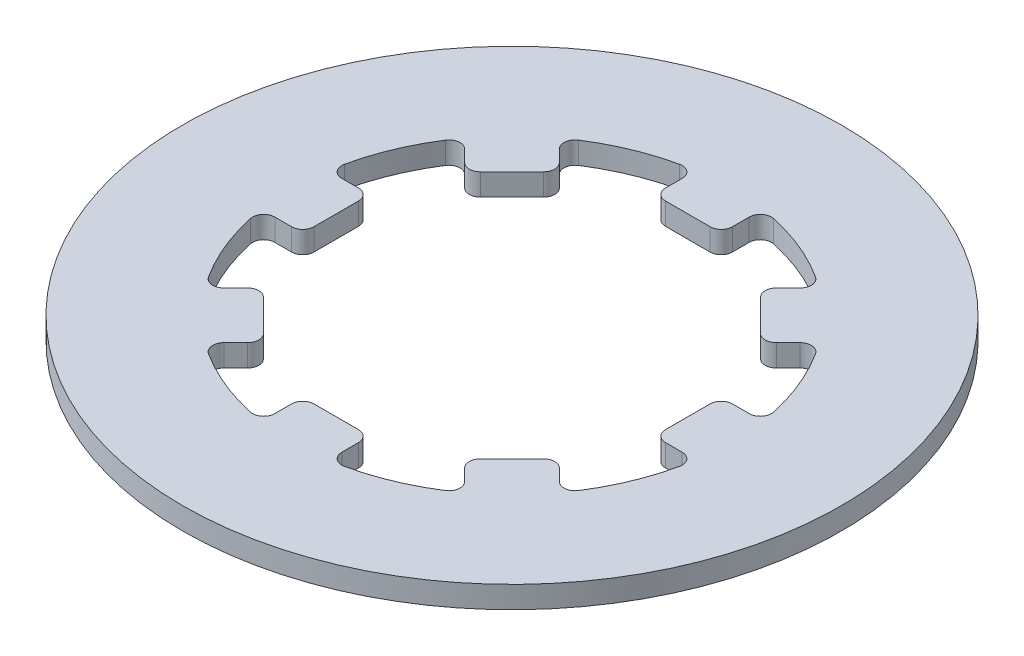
ISO-10303-21;
HEADER;
FILE_DESCRIPTION(('STEP AP214'),'2;1');
FILE_NAME('part.step','',(''),(''),'','','');
FILE_SCHEMA(('AUTOMOTIVE_DESIGN { 1 0 10303 214 1 1 1 1 }'));
ENDSEC;
DATA;
#1=APPLICATION_CONTEXT('core data for automotive mechanical design processes');
#2=APPLICATION_PROTOCOL_DEFINITION('international standard','automotive_design',2000,#1);
#3=PRODUCT_CONTEXT('',#1,'mechanical');
#4=PRODUCT('Part','Part','',(#3));
#5=PRODUCT_RELATED_PRODUCT_CATEGORY('part','',(#4));
#6=PRODUCT_DEFINITION_FORMATION('','',#4);
#7=PRODUCT_DEFINITION_CONTEXT('part definition',#1,'design');
#8=PRODUCT_DEFINITION('design','',#6,#7);
#9=PRODUCT_DEFINITION_SHAPE('','',#8);
#10=(LENGTH_UNIT() NAMED_UNIT(*) SI_UNIT(.MILLI.,.METRE.));
#11=(NAMED_UNIT(*) PLANE_ANGLE_UNIT() SI_UNIT($,.RADIAN.));
#12=(NAMED_UNIT(*) SI_UNIT($,.STERADIAN.) SOLID_ANGLE_UNIT());
#13=UNCERTAINTY_MEASURE_WITH_UNIT(LENGTH_MEASURE(1.E-05),#10,'distance_accuracy_value','');
#14=(GEOMETRIC_REPRESENTATION_CONTEXT(3) GLOBAL_UNCERTAINTY_ASSIGNED_CONTEXT((#13)) GLOBAL_UNIT_ASSIGNED_CONTEXT((#10,
#11,#12)) REPRESENTATION_CONTEXT('',''));
#15=CARTESIAN_POINT('',(0.,0.,0.));
#16=DIRECTION('',(0.,0.,1.));
#17=DIRECTION('',(1.,0.,0.));
#18=AXIS2_PLACEMENT_3D('',#15,#16,#17);
#19=CARTESIAN_POINT('',(0.,0.5,0.));
#20=DIRECTION('',(0.,1.,0.));
#21=DIRECTION('',(0.,0.,1.));
#22=AXIS2_PLACEMENT_3D('',#19,#20,#21);
#23=PLANE('',#22);
#24=CARTESIAN_POINT('',(0.,0.5,0.));
#25=DIRECTION('',(0.,1.,0.));
#26=DIRECTION('',(0.,0.,1.));
#27=AXIS2_PLACEMENT_3D('',#24,#25,#26);
#28=CIRCLE('',#27,7.5);
#29=CARTESIAN_POINT('',(0.,0.5,7.5));
#30=VERTEX_POINT('',#29);
#31=EDGE_CURVE('E461',#30,#30,#28,.T.);
#32=ORIENTED_EDGE('',*,*,#31,.T.);
#33=EDGE_LOOP('',(#32));
#34=FACE_BOUND('',#33,.T.);
#35=DIRECTION('',(1.,0.,0.));
#36=VECTOR('',#35,1.);
#37=CARTESIAN_POINT('',(4.94159447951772,0.5,-0.762));
#38=LINE('',#37,#36);
#39=CARTESIAN_POINT('',(4.254,0.5,-0.762));
#40=VERTEX_POINT('',#39);
#41=CARTESIAN_POINT('',(4.63597454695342,0.5,-0.762));
#42=VERTEX_POINT('',#41);
#43=EDGE_CURVE('E833',#40,#42,#38,.T.);
#44=ORIENTED_EDGE('',*,*,#43,.F.);
#45=CARTESIAN_POINT('',(4.254,0.5,-0.508));
#46=DIRECTION('',(0.,1.,0.));
#47=DIRECTION('',(0.,0.,1.));
#48=AXIS2_PLACEMENT_3D('',#45,#46,#47);
#49=CIRCLE('',#48,0.254);
#50=CARTESIAN_POINT('',(4.,0.5,-0.508));
#51=VERTEX_POINT('',#50);
#52=EDGE_CURVE('E460',#40,#51,#49,.T.);
#53=ORIENTED_EDGE('',*,*,#52,.T.);
#54=DIRECTION('',(0.,0.,-1.));
#55=VECTOR('',#54,1.);
#56=CARTESIAN_POINT('',(4.,0.5,-0.762));
#57=LINE('',#56,#55);
#58=CARTESIAN_POINT('',(4.,0.5,0.507999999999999));
#59=VERTEX_POINT('',#58);
#60=EDGE_CURVE('E830',#59,#51,#57,.T.);
#61=ORIENTED_EDGE('',*,*,#60,.F.);
#62=CARTESIAN_POINT('',(4.254,0.5,0.508));
#63=DIRECTION('',(0.,1.,0.));
#64=DIRECTION('',(0.,0.,1.));
#65=AXIS2_PLACEMENT_3D('',#62,#63,#64);
#66=CIRCLE('',#65,0.254);
#67=CARTESIAN_POINT('',(4.254,0.5,0.762));
#68=VERTEX_POINT('',#67);
#69=EDGE_CURVE('E533',#59,#68,#66,.T.);
#70=ORIENTED_EDGE('',*,*,#69,.T.);
#71=DIRECTION('',(-1.,0.,0.));
#72=VECTOR('',#71,1.);
#73=CARTESIAN_POINT('',(4.,0.5,0.762));
#74=LINE('',#73,#72);
#75=CARTESIAN_POINT('',(4.63597454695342,0.5,0.762));
#76=VERTEX_POINT('',#75);
#77=EDGE_CURVE('E827',#76,#68,#74,.T.);
#78=ORIENTED_EDGE('',*,*,#77,.F.);
#79=CARTESIAN_POINT('',(4.63597454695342,0.5,1.016));
#80=DIRECTION('',(0.,1.,0.));
#81=DIRECTION('',(0.,0.,1.));
#82=AXIS2_PLACEMENT_3D('',#79,#80,#81);
#83=CIRCLE('',#82,0.254);
#84=CARTESIAN_POINT('',(4.8840861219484,0.5,1.07037505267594));
#85=VERTEX_POINT('',#84);
#86=EDGE_CURVE('E686',#76,#85,#83,.F.);
#87=ORIENTED_EDGE('',*,*,#86,.T.);
#88=CARTESIAN_POINT('',(0.,0.5,0.));
#89=DIRECTION('',(0.,1.,0.));
#90=DIRECTION('',(0.,0.,1.));
#91=AXIS2_PLACEMENT_3D('',#88,#89,#90);
#92=CIRCLE('',#91,5.);
#93=CARTESIAN_POINT('',(4.21043987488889,0.5,2.69670095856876));
#94=VERTEX_POINT('',#93);
#95=EDGE_CURVE('E824',#94,#85,#92,.T.);
#96=ORIENTED_EDGE('',*,*,#95,.F.);
#97=CARTESIAN_POINT('',(3.99654952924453,0.5,2.55970854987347));
#98=DIRECTION('',(0.,1.,0.));
#99=DIRECTION('',(0.,0.,1.));
#100=AXIS2_PLACEMENT_3D('',#97,#98,#99);
#101=CIRCLE('',#100,0.254);
#102=CARTESIAN_POINT('',(3.81694440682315,0.5,2.73931367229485));
#103=VERTEX_POINT('',#102);
#104=EDGE_CURVE('E690',#94,#103,#101,.F.);
#105=ORIENTED_EDGE('',*,*,#104,.T.);
#106=DIRECTION('',(0.707106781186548,0.,0.707106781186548));
#107=VECTOR('',#106,1.);
#108=CARTESIAN_POINT('',(4.03305033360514,0.5,2.95541959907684));
#109=LINE('',#108,#107);
#110=CARTESIAN_POINT('',(3.54684761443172,0.5,2.46921687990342));
#111=VERTEX_POINT('',#110);
#112=EDGE_CURVE('E821',#111,#103,#109,.T.);
#113=ORIENTED_EDGE('',*,*,#112,.F.);
#114=CARTESIAN_POINT('',(3.36724249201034,0.5,2.64882200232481));
#115=DIRECTION('',(0.,1.,0.));
#116=DIRECTION('',(0.,0.,1.));
#117=AXIS2_PLACEMENT_3D('',#114,#115,#116);
#118=CIRCLE('',#117,0.254);
#119=CARTESIAN_POINT('',(3.18763736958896,0.5,2.46921687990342));
#120=VERTEX_POINT('',#119);
#121=EDGE_CURVE('E531',#111,#120,#118,.T.);
#122=ORIENTED_EDGE('',*,*,#121,.T.);
#123=DIRECTION('',(0.707106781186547,0.,-0.707106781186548));
#124=VECTOR('',#123,1.);
#125=CARTESIAN_POINT('',(3.36724249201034,0.5,2.28961175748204));
#126=LINE('',#125,#124);
#127=CARTESIAN_POINT('',(2.46921687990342,0.5,3.18763736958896));
#128=VERTEX_POINT('',#127);
#129=EDGE_CURVE('E818',#128,#120,#126,.T.);
#130=ORIENTED_EDGE('',*,*,#129,.F.);
#131=CARTESIAN_POINT('',(2.64882200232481,0.5,3.36724249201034));
#132=DIRECTION('',(0.,1.,0.));
#133=DIRECTION('',(0.,0.,1.));
#134=AXIS2_PLACEMENT_3D('',#131,#132,#133);
#135=CIRCLE('',#134,0.254);
#136=CARTESIAN_POINT('',(2.46921687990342,0.5,3.54684761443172));
#137=VERTEX_POINT('',#136);
#138=EDGE_CURVE('E529',#128,#137,#135,.T.);
#139=ORIENTED_EDGE('',*,*,#138,.T.);
#140=DIRECTION('',(-0.707106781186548,0.,-0.707106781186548));
#141=VECTOR('',#140,1.);
#142=CARTESIAN_POINT('',(2.28961175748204,0.5,3.36724249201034));
#143=LINE('',#142,#141);
#144=CARTESIAN_POINT('',(2.73931367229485,0.5,3.81694440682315));
#145=VERTEX_POINT('',#144);
#146=EDGE_CURVE('E815',#145,#137,#143,.T.);
#147=ORIENTED_EDGE('',*,*,#146,.F.);
#148=CARTESIAN_POINT('',(2.55970854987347,0.5,3.99654952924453));
#149=DIRECTION('',(0.,1.,0.));
#150=DIRECTION('',(0.,0.,1.));
#151=AXIS2_PLACEMENT_3D('',#148,#149,#150);
#152=CIRCLE('',#151,0.254);
#153=CARTESIAN_POINT('',(2.69670095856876,0.5,4.21043987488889));
#154=VERTEX_POINT('',#153);
#155=EDGE_CURVE('E694',#145,#154,#152,.F.);
#156=ORIENTED_EDGE('',*,*,#155,.T.);
#157=CARTESIAN_POINT('',(0.,0.5,0.));
#158=DIRECTION('',(0.,1.,0.));
#159=DIRECTION('',(0.,0.,1.));
#160=AXIS2_PLACEMENT_3D('',#157,#158,#159);
#161=CIRCLE('',#160,5.);
#162=CARTESIAN_POINT('',(1.07037505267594,0.5,4.8840861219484));
#163=VERTEX_POINT('',#162);
#164=EDGE_CURVE('E812',#163,#154,#161,.T.);
#165=ORIENTED_EDGE('',*,*,#164,.F.);
#166=CARTESIAN_POINT('',(1.016,0.5,4.63597454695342));
#167=DIRECTION('',(0.,1.,0.));
#168=DIRECTION('',(0.,0.,1.));
#169=AXIS2_PLACEMENT_3D('',#166,#167,#168);
#170=CIRCLE('',#169,0.254);
#171=CARTESIAN_POINT('',(0.762000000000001,0.5,4.63597454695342));
#172=VERTEX_POINT('',#171);
#173=EDGE_CURVE('E698',#163,#172,#170,.F.);
#174=ORIENTED_EDGE('',*,*,#173,.T.);
#175=DIRECTION('',(0.,0.,1.));
#176=VECTOR('',#175,1.);
#177=CARTESIAN_POINT('',(0.762000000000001,0.5,4.94159447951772));
#178=LINE('',#177,#176);
#179=CARTESIAN_POINT('',(0.762000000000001,0.5,4.254));
#180=VERTEX_POINT('',#179);
#181=EDGE_CURVE('E809',#180,#172,#178,.T.);
#182=ORIENTED_EDGE('',*,*,#181,.F.);
#183=CARTESIAN_POINT('',(0.508000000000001,0.5,4.254));
#184=DIRECTION('',(0.,1.,0.));
#185=DIRECTION('',(0.,0.,1.));
#186=AXIS2_PLACEMENT_3D('',#183,#184,#185);
#187=CIRCLE('',#186,0.254);
#188=CARTESIAN_POINT('',(0.508000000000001,0.5,4.));
#189=VERTEX_POINT('',#188);
#190=EDGE_CURVE('E527',#180,#189,#187,.T.);
#191=ORIENTED_EDGE('',*,*,#190,.T.);
#192=DIRECTION('',(1.,0.,0.));
#193=VECTOR('',#192,1.);
#194=CARTESIAN_POINT('',(0.762000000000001,0.5,4.));
#195=LINE('',#194,#193);
#196=CARTESIAN_POINT('',(-0.507999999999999,0.5,4.));
#197=VERTEX_POINT('',#196);
#198=EDGE_CURVE('E806',#197,#189,#195,.T.);
#199=ORIENTED_EDGE('',*,*,#198,.F.);
#200=CARTESIAN_POINT('',(-0.507999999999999,0.5,4.254));
#201=DIRECTION('',(0.,1.,0.));
#202=DIRECTION('',(0.,0.,1.));
#203=AXIS2_PLACEMENT_3D('',#200,#201,#202);
#204=CIRCLE('',#203,0.254);
#205=CARTESIAN_POINT('',(-0.761999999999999,0.5,4.254));
#206=VERTEX_POINT('',#205);
#207=EDGE_CURVE('E525',#197,#206,#204,.T.);
#208=ORIENTED_EDGE('',*,*,#207,.T.);
#209=DIRECTION('',(0.,0.,-1.));
#210=VECTOR('',#209,1.);
#211=CARTESIAN_POINT('',(-0.761999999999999,0.5,4.));
#212=LINE('',#211,#210);
#213=CARTESIAN_POINT('',(-0.761999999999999,0.5,4.63597454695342));
#214=VERTEX_POINT('',#213);
#215=EDGE_CURVE('E803',#214,#206,#212,.T.);
#216=ORIENTED_EDGE('',*,*,#215,.F.);
#217=CARTESIAN_POINT('',(-1.016,0.5,4.63597454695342));
#218=DIRECTION('',(0.,1.,0.));
#219=DIRECTION('',(0.,0.,1.));
#220=AXIS2_PLACEMENT_3D('',#217,#218,#219);
#221=CIRCLE('',#220,0.254);
#222=CARTESIAN_POINT('',(-1.07037505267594,0.5,4.8840861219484));
#223=VERTEX_POINT('',#222);
#224=EDGE_CURVE('E702',#214,#223,#221,.F.);
#225=ORIENTED_EDGE('',*,*,#224,.T.);
#226=CARTESIAN_POINT('',(0.,0.5,0.));
#227=DIRECTION('',(0.,1.,0.));
#228=DIRECTION('',(0.,0.,1.));
#229=AXIS2_PLACEMENT_3D('',#226,#227,#228);
#230=CIRCLE('',#229,5.);
#231=CARTESIAN_POINT('',(-2.69670095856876,0.5,4.21043987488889));
#232=VERTEX_POINT('',#231);
#233=EDGE_CURVE('E800',#232,#223,#230,.T.);
#234=ORIENTED_EDGE('',*,*,#233,.F.);
#235=CARTESIAN_POINT('',(-2.55970854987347,0.5,3.99654952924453));
#236=DIRECTION('',(0.,1.,0.));
#237=DIRECTION('',(0.,0.,1.));
#238=AXIS2_PLACEMENT_3D('',#235,#236,#237);
#239=CIRCLE('',#238,0.254);
#240=CARTESIAN_POINT('',(-2.73931367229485,0.5,3.81694440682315));
#241=VERTEX_POINT('',#240);
#242=EDGE_CURVE('E706',#232,#241,#239,.F.);
#243=ORIENTED_EDGE('',*,*,#242,.T.);
#244=DIRECTION('',(-0.707106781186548,0.,0.707106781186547));
#245=VECTOR('',#244,1.);
#246=CARTESIAN_POINT('',(-2.95541959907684,0.5,4.03305033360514));
#247=LINE('',#246,#245);
#248=CARTESIAN_POINT('',(-2.46921687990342,0.5,3.54684761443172));
#249=VERTEX_POINT('',#248);
#250=EDGE_CURVE('E797',#249,#241,#247,.T.);
#251=ORIENTED_EDGE('',*,*,#250,.F.);
#252=CARTESIAN_POINT('',(-2.64882200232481,0.5,3.36724249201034));
#253=DIRECTION('',(0.,1.,0.));
#254=DIRECTION('',(0.,0.,1.));
#255=AXIS2_PLACEMENT_3D('',#252,#253,#254);
#256=CIRCLE('',#255,0.254);
#257=CARTESIAN_POINT('',(-2.46921687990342,0.5,3.18763736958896));
#258=VERTEX_POINT('',#257);
#259=EDGE_CURVE('E523',#249,#258,#256,.T.);
#260=ORIENTED_EDGE('',*,*,#259,.T.);
#261=DIRECTION('',(0.707106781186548,0.,0.707106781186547));
#262=VECTOR('',#261,1.);
#263=CARTESIAN_POINT('',(-2.28961175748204,0.5,3.36724249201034));
#264=LINE('',#263,#262);
#265=CARTESIAN_POINT('',(-3.18763736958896,0.5,2.46921687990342));
#266=VERTEX_POINT('',#265);
#267=EDGE_CURVE('E794',#266,#258,#264,.T.);
#268=ORIENTED_EDGE('',*,*,#267,.F.);
#269=CARTESIAN_POINT('',(-3.36724249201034,0.5,2.64882200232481));
#270=DIRECTION('',(0.,1.,0.));
#271=DIRECTION('',(0.,0.,1.));
#272=AXIS2_PLACEMENT_3D('',#269,#270,#271);
#273=CIRCLE('',#272,0.254);
#274=CARTESIAN_POINT('',(-3.54684761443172,0.5,2.46921687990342));
#275=VERTEX_POINT('',#274);
#276=EDGE_CURVE('E521',#266,#275,#273,.T.);
#277=ORIENTED_EDGE('',*,*,#276,.T.);
#278=DIRECTION('',(0.707106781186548,0.,-0.707106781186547));
#279=VECTOR('',#278,1.);
#280=CARTESIAN_POINT('',(-3.36724249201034,0.5,2.28961175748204));
#281=LINE('',#280,#279);
#282=CARTESIAN_POINT('',(-3.81694440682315,0.5,2.73931367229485));
#283=VERTEX_POINT('',#282);
#284=EDGE_CURVE('E791',#283,#275,#281,.T.);
#285=ORIENTED_EDGE('',*,*,#284,.F.);
#286=CARTESIAN_POINT('',(-3.99654952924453,0.5,2.55970854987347));
#287=DIRECTION('',(0.,1.,0.));
#288=DIRECTION('',(0.,0.,1.));
#289=AXIS2_PLACEMENT_3D('',#286,#287,#288);
#290=CIRCLE('',#289,0.254);
#291=CARTESIAN_POINT('',(-4.21043987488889,0.5,2.69670095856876));
#292=VERTEX_POINT('',#291);
#293=EDGE_CURVE('E710',#283,#292,#290,.F.);
#294=ORIENTED_EDGE('',*,*,#293,.T.);
#295=CARTESIAN_POINT('',(0.,0.5,0.));
#296=DIRECTION('',(0.,1.,0.));
#297=DIRECTION('',(0.,0.,1.));
#298=AXIS2_PLACEMENT_3D('',#295,#296,#297);
#299=CIRCLE('',#298,5.);
#300=CARTESIAN_POINT('',(-4.8840861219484,0.5,1.07037505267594));
#301=VERTEX_POINT('',#300);
#302=EDGE_CURVE('E788',#301,#292,#299,.T.);
#303=ORIENTED_EDGE('',*,*,#302,.F.);
#304=CARTESIAN_POINT('',(-4.63597454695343,0.5,1.016));
#305=DIRECTION('',(0.,1.,0.));
#306=DIRECTION('',(0.,0.,1.));
#307=AXIS2_PLACEMENT_3D('',#304,#305,#306);
#308=CIRCLE('',#307,0.254);
#309=CARTESIAN_POINT('',(-4.63597454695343,0.5,0.762000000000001));
#310=VERTEX_POINT('',#309);
#311=EDGE_CURVE('E714',#301,#310,#308,.F.);
#312=ORIENTED_EDGE('',*,*,#311,.T.);
#313=DIRECTION('',(-1.,0.,0.));
#314=VECTOR('',#313,1.);
#315=CARTESIAN_POINT('',(-4.94159447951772,0.5,0.762000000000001));
#316=LINE('',#315,#314);
#317=CARTESIAN_POINT('',(-4.254,0.5,0.762000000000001));
#318=VERTEX_POINT('',#317);
#319=EDGE_CURVE('E785',#318,#310,#316,.T.);
#320=ORIENTED_EDGE('',*,*,#319,.F.);
#321=CARTESIAN_POINT('',(-4.254,0.5,0.508000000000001));
#322=DIRECTION('',(0.,1.,0.));
#323=DIRECTION('',(0.,0.,1.));
#324=AXIS2_PLACEMENT_3D('',#321,#322,#323);
#325=CIRCLE('',#324,0.254);
#326=CARTESIAN_POINT('',(-4.,0.5,0.508000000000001));
#327=VERTEX_POINT('',#326);
#328=EDGE_CURVE('E519',#318,#327,#325,.T.);
#329=ORIENTED_EDGE('',*,*,#328,.T.);
#330=DIRECTION('',(0.,0.,1.));
#331=VECTOR('',#330,1.);
#332=CARTESIAN_POINT('',(-4.,0.5,0.762000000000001));
#333=LINE('',#332,#331);
#334=CARTESIAN_POINT('',(-4.,0.5,-0.507999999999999));
#335=VERTEX_POINT('',#334);
#336=EDGE_CURVE('E782',#335,#327,#333,.T.);
#337=ORIENTED_EDGE('',*,*,#336,.F.);
#338=CARTESIAN_POINT('',(-4.254,0.5,-0.507999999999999));
#339=DIRECTION('',(0.,1.,0.));
#340=DIRECTION('',(0.,0.,1.));
#341=AXIS2_PLACEMENT_3D('',#338,#339,#340);
#342=CIRCLE('',#341,0.254);
#343=CARTESIAN_POINT('',(-4.254,0.5,-0.761999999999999));
#344=VERTEX_POINT('',#343);
#345=EDGE_CURVE('E517',#335,#344,#342,.T.);
#346=ORIENTED_EDGE('',*,*,#345,.T.);
#347=DIRECTION('',(1.,0.,0.));
#348=VECTOR('',#347,1.);
#349=CARTESIAN_POINT('',(-4.,0.5,-0.761999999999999));
#350=LINE('',#349,#348);
#351=CARTESIAN_POINT('',(-4.63597454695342,0.5,-0.761999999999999));
#352=VERTEX_POINT('',#351);
#353=EDGE_CURVE('E779',#352,#344,#350,.T.);
#354=ORIENTED_EDGE('',*,*,#353,.F.);
#355=CARTESIAN_POINT('',(-4.63597454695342,0.5,-1.016));
#356=DIRECTION('',(0.,1.,0.));
#357=DIRECTION('',(0.,0.,1.));
#358=AXIS2_PLACEMENT_3D('',#355,#356,#357);
#359=CIRCLE('',#358,0.254);
#360=CARTESIAN_POINT('',(-4.8840861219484,0.5,-1.07037505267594));
#361=VERTEX_POINT('',#360);
#362=EDGE_CURVE('E718',#352,#361,#359,.F.);
#363=ORIENTED_EDGE('',*,*,#362,.T.);
#364=CARTESIAN_POINT('',(0.,0.5,0.));
#365=DIRECTION('',(0.,1.,0.));
#366=DIRECTION('',(0.,0.,1.));
#367=AXIS2_PLACEMENT_3D('',#364,#365,#366);
#368=CIRCLE('',#367,5.);
#369=CARTESIAN_POINT('',(-4.21043987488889,0.5,-2.69670095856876));
#370=VERTEX_POINT('',#369);
#371=EDGE_CURVE('E776',#370,#361,#368,.T.);
#372=ORIENTED_EDGE('',*,*,#371,.F.);
#373=CARTESIAN_POINT('',(-3.99654952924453,0.5,-2.55970854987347));
#374=DIRECTION('',(0.,1.,0.));
#375=DIRECTION('',(0.,0.,1.));
#376=AXIS2_PLACEMENT_3D('',#373,#374,#375);
#377=CIRCLE('',#376,0.254);
#378=CARTESIAN_POINT('',(-3.81694440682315,0.5,-2.73931367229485));
#379=VERTEX_POINT('',#378);
#380=EDGE_CURVE('E722',#370,#379,#377,.F.);
#381=ORIENTED_EDGE('',*,*,#380,.T.);
#382=DIRECTION('',(-0.707106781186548,0.,-0.707106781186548));
#383=VECTOR('',#382,1.);
#384=CARTESIAN_POINT('',(-4.03305033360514,0.5,-2.95541959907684));
#385=LINE('',#384,#383);
#386=CARTESIAN_POINT('',(-3.54684761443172,0.5,-2.46921687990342));
#387=VERTEX_POINT('',#386);
#388=EDGE_CURVE('E773',#387,#379,#385,.T.);
#389=ORIENTED_EDGE('',*,*,#388,.F.);
#390=CARTESIAN_POINT('',(-3.36724249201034,0.5,-2.64882200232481));
#391=DIRECTION('',(0.,1.,0.));
#392=DIRECTION('',(0.,0.,1.));
#393=AXIS2_PLACEMENT_3D('',#390,#391,#392);
#394=CIRCLE('',#393,0.254);
#395=CARTESIAN_POINT('',(-3.18763736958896,0.5,-2.46921687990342));
#396=VERTEX_POINT('',#395);
#397=EDGE_CURVE('E48',#387,#396,#394,.T.);
#398=ORIENTED_EDGE('',*,*,#397,.T.);
#399=DIRECTION('',(-0.707106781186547,0.,0.707106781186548));
#400=VECTOR('',#399,1.);
#401=CARTESIAN_POINT('',(-3.36724249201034,0.5,-2.28961175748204));
#402=LINE('',#401,#400);
#403=CARTESIAN_POINT('',(-2.46921687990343,0.5,-3.18763736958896));
#404=VERTEX_POINT('',#403);
#405=EDGE_CURVE('E766',#404,#396,#402,.T.);
#406=ORIENTED_EDGE('',*,*,#405,.F.);
#407=CARTESIAN_POINT('',(-2.64882200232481,0.5,-3.36724249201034));
#408=DIRECTION('',(0.,1.,0.));
#409=DIRECTION('',(0.,0.,1.));
#410=AXIS2_PLACEMENT_3D('',#407,#408,#409);
#411=CIRCLE('',#410,0.254);
#412=CARTESIAN_POINT('',(-2.46921687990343,0.5,-3.54684761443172));
#413=VERTEX_POINT('',#412);
#414=EDGE_CURVE('E515',#404,#413,#411,.T.);
#415=ORIENTED_EDGE('',*,*,#414,.T.);
#416=DIRECTION('',(0.707106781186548,0.,0.707106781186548));
#417=VECTOR('',#416,1.);
#418=CARTESIAN_POINT('',(-2.28961175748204,0.5,-3.36724249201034));
#419=LINE('',#418,#417);
#420=CARTESIAN_POINT('',(-2.73931367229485,0.5,-3.81694440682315));
#421=VERTEX_POINT('',#420);
#422=EDGE_CURVE('E760',#421,#413,#419,.T.);
#423=ORIENTED_EDGE('',*,*,#422,.F.);
#424=CARTESIAN_POINT('',(-2.55970854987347,0.5,-3.99654952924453));
#425=DIRECTION('',(0.,1.,0.));
#426=DIRECTION('',(0.,0.,1.));
#427=AXIS2_PLACEMENT_3D('',#424,#425,#426);
#428=CIRCLE('',#427,0.254);
#429=CARTESIAN_POINT('',(-2.69670095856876,0.5,-4.21043987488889));
#430=VERTEX_POINT('',#429);
#431=EDGE_CURVE('E11',#421,#430,#428,.F.);
#432=ORIENTED_EDGE('',*,*,#431,.T.);
#433=CARTESIAN_POINT('',(0.,0.5,0.));
#434=DIRECTION('',(0.,1.,0.));
#435=DIRECTION('',(0.,0.,1.));
#436=AXIS2_PLACEMENT_3D('',#433,#434,#435);
#437=CIRCLE('',#436,5.);
#438=CARTESIAN_POINT('',(-1.07037505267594,0.5,-4.8840861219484));
#439=VERTEX_POINT('',#438);
#440=EDGE_CURVE('E758',#439,#430,#437,.T.);
#441=ORIENTED_EDGE('',*,*,#440,.F.);
#442=CARTESIAN_POINT('',(-1.016,0.5,-4.63597454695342));
#443=DIRECTION('',(0.,1.,0.));
#444=DIRECTION('',(0.,0.,1.));
#445=AXIS2_PLACEMENT_3D('',#442,#443,#444);
#446=CIRCLE('',#445,0.254);
#447=CARTESIAN_POINT('',(-0.762,0.5,-4.63597454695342));
#448=VERTEX_POINT('',#447);
#449=EDGE_CURVE('E738',#439,#448,#446,.F.);
#450=ORIENTED_EDGE('',*,*,#449,.T.);
#451=DIRECTION('',(0.,0.,-1.));
#452=VECTOR('',#451,1.);
#453=CARTESIAN_POINT('',(-0.762,0.5,-4.94159447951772));
#454=LINE('',#453,#452);
#455=CARTESIAN_POINT('',(-0.762,0.5,-4.254));
#456=VERTEX_POINT('',#455);
#457=EDGE_CURVE('E856',#456,#448,#454,.T.);
#458=ORIENTED_EDGE('',*,*,#457,.F.);
#459=CARTESIAN_POINT('',(-0.508,0.5,-4.254));
#460=DIRECTION('',(0.,1.,0.));
#461=DIRECTION('',(0.,0.,1.));
#462=AXIS2_PLACEMENT_3D('',#459,#460,#461);
#463=CIRCLE('',#462,0.254);
#464=CARTESIAN_POINT('',(-0.508,0.5,-4.));
#465=VERTEX_POINT('',#464);
#466=EDGE_CURVE('E445',#456,#465,#463,.T.);
#467=ORIENTED_EDGE('',*,*,#466,.T.);
#468=DIRECTION('',(-1.,0.,0.));
#469=VECTOR('',#468,1.);
#470=CARTESIAN_POINT('',(-0.762,0.5,-4.));
#471=LINE('',#470,#469);
#472=CARTESIAN_POINT('',(0.507999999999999,0.5,-4.));
#473=VERTEX_POINT('',#472);
#474=EDGE_CURVE('E853',#473,#465,#471,.T.);
#475=ORIENTED_EDGE('',*,*,#474,.F.);
#476=CARTESIAN_POINT('',(0.508,0.5,-4.254));
#477=DIRECTION('',(0.,1.,0.));
#478=DIRECTION('',(0.,0.,1.));
#479=AXIS2_PLACEMENT_3D('',#476,#477,#478);
#480=CIRCLE('',#479,0.254);
#481=CARTESIAN_POINT('',(0.762,0.5,-4.254));
#482=VERTEX_POINT('',#481);
#483=EDGE_CURVE('E508',#473,#482,#480,.T.);
#484=ORIENTED_EDGE('',*,*,#483,.T.);
#485=DIRECTION('',(0.,0.,1.));
#486=VECTOR('',#485,1.);
#487=CARTESIAN_POINT('',(0.762,0.5,-4.));
#488=LINE('',#487,#486);
#489=CARTESIAN_POINT('',(0.762,0.5,-4.63597454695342));
#490=VERTEX_POINT('',#489);
#491=EDGE_CURVE('E850',#490,#482,#488,.T.);
#492=ORIENTED_EDGE('',*,*,#491,.F.);
#493=CARTESIAN_POINT('',(1.016,0.5,-4.63597454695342));
#494=DIRECTION('',(0.,1.,0.));
#495=DIRECTION('',(0.,0.,1.));
#496=AXIS2_PLACEMENT_3D('',#493,#494,#495);
#497=CIRCLE('',#496,0.254);
#498=CARTESIAN_POINT('',(1.07037505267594,0.5,-4.8840861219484));
#499=VERTEX_POINT('',#498);
#500=EDGE_CURVE('E734',#490,#499,#497,.F.);
#501=ORIENTED_EDGE('',*,*,#500,.T.);
#502=CARTESIAN_POINT('',(0.,0.5,0.));
#503=DIRECTION('',(0.,1.,0.));
#504=DIRECTION('',(0.,0.,1.));
#505=AXIS2_PLACEMENT_3D('',#502,#503,#504);
#506=CIRCLE('',#505,5.);
#507=CARTESIAN_POINT('',(2.69670095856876,0.5,-4.21043987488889));
#508=VERTEX_POINT('',#507);
#509=EDGE_CURVE('E847',#508,#499,#506,.T.);
#510=ORIENTED_EDGE('',*,*,#509,.F.);
#511=CARTESIAN_POINT('',(2.55970854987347,0.5,-3.99654952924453));
#512=DIRECTION('',(0.,1.,0.));
#513=DIRECTION('',(0.,0.,1.));
#514=AXIS2_PLACEMENT_3D('',#511,#512,#513);
#515=CIRCLE('',#514,0.254);
#516=CARTESIAN_POINT('',(2.73931367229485,0.5,-3.81694440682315));
#517=VERTEX_POINT('',#516);
#518=EDGE_CURVE('E730',#508,#517,#515,.F.);
#519=ORIENTED_EDGE('',*,*,#518,.T.);
#520=DIRECTION('',(0.707106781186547,0.,-0.707106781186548));
#521=VECTOR('',#520,1.);
#522=CARTESIAN_POINT('',(2.95541959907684,0.5,-4.03305033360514));
#523=LINE('',#522,#521);
#524=CARTESIAN_POINT('',(2.46921687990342,0.5,-3.54684761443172));
#525=VERTEX_POINT('',#524);
#526=EDGE_CURVE('E844',#525,#517,#523,.T.);
#527=ORIENTED_EDGE('',*,*,#526,.F.);
#528=CARTESIAN_POINT('',(2.64882200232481,0.5,-3.36724249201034));
#529=DIRECTION('',(0.,1.,0.));
#530=DIRECTION('',(0.,0.,1.));
#531=AXIS2_PLACEMENT_3D('',#528,#529,#530);
#532=CIRCLE('',#531,0.254);
#533=CARTESIAN_POINT('',(2.46921687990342,0.5,-3.18763736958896));
#534=VERTEX_POINT('',#533);
#535=EDGE_CURVE('E510',#525,#534,#532,.T.);
#536=ORIENTED_EDGE('',*,*,#535,.T.);
#537=DIRECTION('',(-0.707106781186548,0.,-0.707106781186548));
#538=VECTOR('',#537,1.);
#539=CARTESIAN_POINT('',(2.28961175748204,0.5,-3.36724249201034));
#540=LINE('',#539,#538);
#541=CARTESIAN_POINT('',(3.18763736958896,0.5,-2.46921687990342));
#542=VERTEX_POINT('',#541);
#543=EDGE_CURVE('E841',#542,#534,#540,.T.);
#544=ORIENTED_EDGE('',*,*,#543,.F.);
#545=CARTESIAN_POINT('',(3.36724249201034,0.5,-2.64882200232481));
#546=DIRECTION('',(0.,1.,0.));
#547=DIRECTION('',(0.,0.,1.));
#548=AXIS2_PLACEMENT_3D('',#545,#546,#547);
#549=CIRCLE('',#548,0.254);
#550=CARTESIAN_POINT('',(3.54684761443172,0.5,-2.46921687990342));
#551=VERTEX_POINT('',#550);
#552=EDGE_CURVE('E512',#542,#551,#549,.T.);
#553=ORIENTED_EDGE('',*,*,#552,.T.);
#554=DIRECTION('',(-0.707106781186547,0.,0.707106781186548));
#555=VECTOR('',#554,1.);
#556=CARTESIAN_POINT('',(3.36724249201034,0.5,-2.28961175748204));
#557=LINE('',#556,#555);
#558=CARTESIAN_POINT('',(3.81694440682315,0.5,-2.73931367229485));
#559=VERTEX_POINT('',#558);
#560=EDGE_CURVE('E838',#559,#551,#557,.T.);
#561=ORIENTED_EDGE('',*,*,#560,.F.);
#562=CARTESIAN_POINT('',(3.99654952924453,0.5,-2.55970854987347));
#563=DIRECTION('',(0.,1.,0.));
#564=DIRECTION('',(0.,0.,1.));
#565=AXIS2_PLACEMENT_3D('',#562,#563,#564);
#566=CIRCLE('',#565,0.254);
#567=CARTESIAN_POINT('',(4.21043987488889,0.5,-2.69670095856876));
#568=VERTEX_POINT('',#567);
#569=EDGE_CURVE('E726',#559,#568,#566,.F.);
#570=ORIENTED_EDGE('',*,*,#569,.T.);
#571=CARTESIAN_POINT('',(0.,0.5,0.));
#572=DIRECTION('',(0.,1.,0.));
#573=DIRECTION('',(0.,0.,1.));
#574=AXIS2_PLACEMENT_3D('',#571,#572,#573);
#575=CIRCLE('',#574,5.);
#576=CARTESIAN_POINT('',(4.8840861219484,0.5,-1.07037505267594));
#577=VERTEX_POINT('',#576);
#578=EDGE_CURVE('E835',#577,#568,#575,.T.);
#579=ORIENTED_EDGE('',*,*,#578,.F.);
#580=CARTESIAN_POINT('',(4.63597454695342,0.5,-1.016));
#581=DIRECTION('',(0.,1.,0.));
#582=DIRECTION('',(0.,0.,1.));
#583=AXIS2_PLACEMENT_3D('',#580,#581,#582);
#584=CIRCLE('',#583,0.254);
#585=EDGE_CURVE('E682',#577,#42,#584,.F.);
#586=ORIENTED_EDGE('',*,*,#585,.T.);
#587=EDGE_LOOP('',(#44,#53,#61,#70,#78,#87,#96,#105,#113,#122,#130,#139,#147,#156,#165,#174,
#182,#191,#199,#208,#216,#225,#234,#243,#251,#260,#268,#277,#285,#294,#303,#312,#320,#329,#337,
#346,#354,#363,#372,#381,#389,#398,#406,#415,#423,#432,#441,#450,#458,#467,#475,#484,#492,#501,
#510,#519,#527,#536,#544,#553,#561,#570,#579,#586));
#588=FACE_BOUND('',#587,.T.);
#589=ADVANCED_FACE('F33',(#34,#588),#23,.T.);
#590=CARTESIAN_POINT('',(0.,0.,0.));
#591=DIRECTION('',(0.,1.,0.));
#592=DIRECTION('',(0.,0.,1.));
#593=AXIS2_PLACEMENT_3D('',#590,#591,#592);
#594=PLANE('',#593);
#595=CARTESIAN_POINT('',(0.,0.,0.));
#596=DIRECTION('',(0.,1.,0.));
#597=DIRECTION('',(0.,0.,1.));
#598=AXIS2_PLACEMENT_3D('',#595,#596,#597);
#599=CIRCLE('',#598,7.5);
#600=CARTESIAN_POINT('',(0.,0.,7.5));
#601=VERTEX_POINT('',#600);
#602=EDGE_CURVE('E466',#601,#601,#599,.T.);
#603=ORIENTED_EDGE('',*,*,#602,.F.);
#604=EDGE_LOOP('',(#603));
#605=FACE_BOUND('',#604,.T.);
#606=DIRECTION('',(0.,0.,-1.));
#607=VECTOR('',#606,1.);
#608=CARTESIAN_POINT('',(4.,0.,-0.762));
#609=LINE('',#608,#607);
#610=CARTESIAN_POINT('',(4.,0.,0.507999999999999));
#611=VERTEX_POINT('',#610);
#612=CARTESIAN_POINT('',(4.,0.,-0.508));
#613=VERTEX_POINT('',#612);
#614=EDGE_CURVE('E440',#611,#613,#609,.T.);
#615=ORIENTED_EDGE('',*,*,#614,.T.);
#616=CARTESIAN_POINT('',(4.254,0.,-0.508));
#617=DIRECTION('',(0.,1.,0.));
#618=DIRECTION('',(0.,0.,1.));
#619=AXIS2_PLACEMENT_3D('',#616,#617,#618);
#620=CIRCLE('',#619,0.254);
#621=CARTESIAN_POINT('',(4.254,0.,-0.762));
#622=VERTEX_POINT('',#621);
#623=EDGE_CURVE('E435',#613,#622,#620,.F.);
#624=ORIENTED_EDGE('',*,*,#623,.T.);
#625=DIRECTION('',(1.,0.,0.));
#626=VECTOR('',#625,1.);
#627=CARTESIAN_POINT('',(4.94159447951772,0.,-0.762));
#628=LINE('',#627,#626);
#629=CARTESIAN_POINT('',(4.63597454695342,0.,-0.762));
#630=VERTEX_POINT('',#629);
#631=EDGE_CURVE('E438',#622,#630,#628,.T.);
#632=ORIENTED_EDGE('',*,*,#631,.T.);
#633=CARTESIAN_POINT('',(4.63597454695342,0.,-1.016));
#634=DIRECTION('',(0.,1.,0.));
#635=DIRECTION('',(0.,0.,1.));
#636=AXIS2_PLACEMENT_3D('',#633,#634,#635);
#637=CIRCLE('',#636,0.254);
#638=CARTESIAN_POINT('',(4.8840861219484,0.,-1.07037505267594));
#639=VERTEX_POINT('',#638);
#640=EDGE_CURVE('E680',#630,#639,#637,.T.);
#641=ORIENTED_EDGE('',*,*,#640,.T.);
#642=CARTESIAN_POINT('',(0.,0.,0.));
#643=DIRECTION('',(0.,1.,0.));
#644=DIRECTION('',(0.,0.,1.));
#645=AXIS2_PLACEMENT_3D('',#642,#643,#644);
#646=CIRCLE('',#645,5.);
#647=CARTESIAN_POINT('',(4.21043987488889,0.,-2.69670095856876));
#648=VERTEX_POINT('',#647);
#649=EDGE_CURVE('E456',#639,#648,#646,.T.);
#650=ORIENTED_EDGE('',*,*,#649,.T.);
#651=CARTESIAN_POINT('',(3.99654952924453,0.,-2.55970854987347));
#652=DIRECTION('',(0.,1.,0.));
#653=DIRECTION('',(0.,0.,1.));
#654=AXIS2_PLACEMENT_3D('',#651,#652,#653);
#655=CIRCLE('',#654,0.254);
#656=CARTESIAN_POINT('',(3.81694440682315,0.,-2.73931367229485));
#657=VERTEX_POINT('',#656);
#658=EDGE_CURVE('E724',#648,#657,#655,.T.);
#659=ORIENTED_EDGE('',*,*,#658,.T.);
#660=DIRECTION('',(-0.707106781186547,0.,0.707106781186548));
#661=VECTOR('',#660,1.);
#662=CARTESIAN_POINT('',(3.36724249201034,0.,-2.28961175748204));
#663=LINE('',#662,#661);
#664=CARTESIAN_POINT('',(3.54684761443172,0.,-2.46921687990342));
#665=VERTEX_POINT('',#664);
#666=EDGE_CURVE('E922',#657,#665,#663,.T.);
#667=ORIENTED_EDGE('',*,*,#666,.T.);
#668=CARTESIAN_POINT('',(3.36724249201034,0.,-2.64882200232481));
#669=DIRECTION('',(0.,1.,0.));
#670=DIRECTION('',(0.,0.,1.));
#671=AXIS2_PLACEMENT_3D('',#668,#669,#670);
#672=CIRCLE('',#671,0.254);
#673=CARTESIAN_POINT('',(3.18763736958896,0.,-2.46921687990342));
#674=VERTEX_POINT('',#673);
#675=EDGE_CURVE('E484',#665,#674,#672,.F.);
#676=ORIENTED_EDGE('',*,*,#675,.T.);
#677=DIRECTION('',(-0.707106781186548,0.,-0.707106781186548));
#678=VECTOR('',#677,1.);
#679=CARTESIAN_POINT('',(2.28961175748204,0.,-3.36724249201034));
#680=LINE('',#679,#678);
#681=CARTESIAN_POINT('',(2.46921687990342,0.,-3.18763736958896));
#682=VERTEX_POINT('',#681);
#683=EDGE_CURVE('E925',#674,#682,#680,.T.);
#684=ORIENTED_EDGE('',*,*,#683,.T.);
#685=CARTESIAN_POINT('',(2.64882200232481,0.,-3.36724249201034));
#686=DIRECTION('',(0.,1.,0.));
#687=DIRECTION('',(0.,0.,1.));
#688=AXIS2_PLACEMENT_3D('',#685,#686,#687);
#689=CIRCLE('',#688,0.254);
#690=CARTESIAN_POINT('',(2.46921687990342,0.,-3.54684761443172));
#691=VERTEX_POINT('',#690);
#692=EDGE_CURVE('E482',#682,#691,#689,.F.);
#693=ORIENTED_EDGE('',*,*,#692,.T.);
#694=DIRECTION('',(0.707106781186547,0.,-0.707106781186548));
#695=VECTOR('',#694,1.);
#696=CARTESIAN_POINT('',(2.95541959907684,0.,-4.03305033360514));
#697=LINE('',#696,#695);
#698=CARTESIAN_POINT('',(2.73931367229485,0.,-3.81694440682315));
#699=VERTEX_POINT('',#698);
#700=EDGE_CURVE('E928',#691,#699,#697,.T.);
#701=ORIENTED_EDGE('',*,*,#700,.T.);
#702=CARTESIAN_POINT('',(2.55970854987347,0.,-3.99654952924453));
#703=DIRECTION('',(0.,1.,0.));
#704=DIRECTION('',(0.,0.,1.));
#705=AXIS2_PLACEMENT_3D('',#702,#703,#704);
#706=CIRCLE('',#705,0.254);
#707=CARTESIAN_POINT('',(2.69670095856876,0.,-4.21043987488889));
#708=VERTEX_POINT('',#707);
#709=EDGE_CURVE('E728',#699,#708,#706,.T.);
#710=ORIENTED_EDGE('',*,*,#709,.T.);
#711=CARTESIAN_POINT('',(0.,0.,0.));
#712=DIRECTION('',(0.,1.,0.));
#713=DIRECTION('',(0.,0.,1.));
#714=AXIS2_PLACEMENT_3D('',#711,#712,#713);
#715=CIRCLE('',#714,5.);
#716=CARTESIAN_POINT('',(1.07037505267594,0.,-4.8840861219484));
#717=VERTEX_POINT('',#716);
#718=EDGE_CURVE('E931',#708,#717,#715,.T.);
#719=ORIENTED_EDGE('',*,*,#718,.T.);
#720=CARTESIAN_POINT('',(1.016,0.,-4.63597454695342));
#721=DIRECTION('',(0.,1.,0.));
#722=DIRECTION('',(0.,0.,1.));
#723=AXIS2_PLACEMENT_3D('',#720,#721,#722);
#724=CIRCLE('',#723,0.254);
#725=CARTESIAN_POINT('',(0.762,0.,-4.63597454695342));
#726=VERTEX_POINT('',#725);
#727=EDGE_CURVE('E732',#717,#726,#724,.T.);
#728=ORIENTED_EDGE('',*,*,#727,.T.);
#729=DIRECTION('',(0.,0.,1.));
#730=VECTOR('',#729,1.);
#731=CARTESIAN_POINT('',(0.762,0.,-4.));
#732=LINE('',#731,#730);
#733=CARTESIAN_POINT('',(0.762,0.,-4.254));
#734=VERTEX_POINT('',#733);
#735=EDGE_CURVE('E934',#726,#734,#732,.T.);
#736=ORIENTED_EDGE('',*,*,#735,.T.);
#737=CARTESIAN_POINT('',(0.508,0.,-4.254));
#738=DIRECTION('',(0.,1.,0.));
#739=DIRECTION('',(0.,0.,1.));
#740=AXIS2_PLACEMENT_3D('',#737,#738,#739);
#741=CIRCLE('',#740,0.254);
#742=CARTESIAN_POINT('',(0.507999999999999,0.,-4.));
#743=VERTEX_POINT('',#742);
#744=EDGE_CURVE('E480',#734,#743,#741,.F.);
#745=ORIENTED_EDGE('',*,*,#744,.T.);
#746=DIRECTION('',(-1.,0.,0.));
#747=VECTOR('',#746,1.);
#748=CARTESIAN_POINT('',(-0.762,0.,-4.));
#749=LINE('',#748,#747);
#750=CARTESIAN_POINT('',(-0.508,0.,-4.));
#751=VERTEX_POINT('',#750);
#752=EDGE_CURVE('E769',#743,#751,#749,.T.);
#753=ORIENTED_EDGE('',*,*,#752,.T.);
#754=CARTESIAN_POINT('',(-0.508,0.,-4.254));
#755=DIRECTION('',(0.,1.,0.));
#756=DIRECTION('',(0.,0.,1.));
#757=AXIS2_PLACEMENT_3D('',#754,#755,#756);
#758=CIRCLE('',#757,0.254);
#759=CARTESIAN_POINT('',(-0.762,0.,-4.254));
#760=VERTEX_POINT('',#759);
#761=EDGE_CURVE('E478',#751,#760,#758,.F.);
#762=ORIENTED_EDGE('',*,*,#761,.T.);
#763=DIRECTION('',(0.,0.,-1.));
#764=VECTOR('',#763,1.);
#765=CARTESIAN_POINT('',(-0.762,0.,-4.94159447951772));
#766=LINE('',#765,#764);
#767=CARTESIAN_POINT('',(-0.762,0.,-4.63597454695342));
#768=VERTEX_POINT('',#767);
#769=EDGE_CURVE('E764',#760,#768,#766,.T.);
#770=ORIENTED_EDGE('',*,*,#769,.T.);
#771=CARTESIAN_POINT('',(-1.016,0.,-4.63597454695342));
#772=DIRECTION('',(0.,1.,0.));
#773=DIRECTION('',(0.,0.,1.));
#774=AXIS2_PLACEMENT_3D('',#771,#772,#773);
#775=CIRCLE('',#774,0.254);
#776=CARTESIAN_POINT('',(-1.07037505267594,0.,-4.8840861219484));
#777=VERTEX_POINT('',#776);
#778=EDGE_CURVE('E736',#768,#777,#775,.T.);
#779=ORIENTED_EDGE('',*,*,#778,.T.);
#780=CARTESIAN_POINT('',(0.,0.,0.));
#781=DIRECTION('',(0.,1.,0.));
#782=DIRECTION('',(0.,0.,1.));
#783=AXIS2_PLACEMENT_3D('',#780,#781,#782);
#784=CIRCLE('',#783,5.);
#785=CARTESIAN_POINT('',(-2.69670095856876,0.,-4.21043987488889));
#786=VERTEX_POINT('',#785);
#787=EDGE_CURVE('E744',#777,#786,#784,.T.);
#788=ORIENTED_EDGE('',*,*,#787,.T.);
#789=CARTESIAN_POINT('',(-2.55970854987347,0.,-3.99654952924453));
#790=DIRECTION('',(0.,1.,0.));
#791=DIRECTION('',(0.,0.,1.));
#792=AXIS2_PLACEMENT_3D('',#789,#790,#791);
#793=CIRCLE('',#792,0.254);
#794=CARTESIAN_POINT('',(-2.73931367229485,0.,-3.81694440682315));
#795=VERTEX_POINT('',#794);
#796=EDGE_CURVE('E41',#786,#795,#793,.T.);
#797=ORIENTED_EDGE('',*,*,#796,.T.);
#798=DIRECTION('',(0.707106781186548,0.,0.707106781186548));
#799=VECTOR('',#798,1.);
#800=CARTESIAN_POINT('',(-2.28961175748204,0.,-3.36724249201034));
#801=LINE('',#800,#799);
#802=CARTESIAN_POINT('',(-2.46921687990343,0.,-3.54684761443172));
#803=VERTEX_POINT('',#802);
#804=EDGE_CURVE('E742',#795,#803,#801,.T.);
#805=ORIENTED_EDGE('',*,*,#804,.T.);
#806=CARTESIAN_POINT('',(-2.64882200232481,0.,-3.36724249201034));
#807=DIRECTION('',(0.,1.,0.));
#808=DIRECTION('',(0.,0.,1.));
#809=AXIS2_PLACEMENT_3D('',#806,#807,#808);
#810=CIRCLE('',#809,0.254);
#811=CARTESIAN_POINT('',(-2.46921687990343,0.,-3.18763736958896));
#812=VERTEX_POINT('',#811);
#813=EDGE_CURVE('E488',#803,#812,#810,.F.);
#814=ORIENTED_EDGE('',*,*,#813,.T.);
#815=DIRECTION('',(-0.707106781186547,0.,0.707106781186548));
#816=VECTOR('',#815,1.);
#817=CARTESIAN_POINT('',(-3.36724249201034,0.,-2.28961175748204));
#818=LINE('',#817,#816);
#819=CARTESIAN_POINT('',(-3.18763736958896,0.,-2.46921687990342));
#820=VERTEX_POINT('',#819);
#821=EDGE_CURVE('E753',#812,#820,#818,.T.);
#822=ORIENTED_EDGE('',*,*,#821,.T.);
#823=CARTESIAN_POINT('',(-3.36724249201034,0.,-2.64882200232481));
#824=DIRECTION('',(0.,1.,0.));
#825=DIRECTION('',(0.,0.,1.));
#826=AXIS2_PLACEMENT_3D('',#823,#824,#825);
#827=CIRCLE('',#826,0.254);
#828=CARTESIAN_POINT('',(-3.54684761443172,0.,-2.46921687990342));
#829=VERTEX_POINT('',#828);
#830=EDGE_CURVE('E486',#820,#829,#827,.F.);
#831=ORIENTED_EDGE('',*,*,#830,.T.);
#832=DIRECTION('',(-0.707106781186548,0.,-0.707106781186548));
#833=VECTOR('',#832,1.);
#834=CARTESIAN_POINT('',(-4.03305033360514,0.,-2.95541959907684));
#835=LINE('',#834,#833);
#836=CARTESIAN_POINT('',(-3.81694440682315,0.,-2.73931367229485));
#837=VERTEX_POINT('',#836);
#838=EDGE_CURVE('E862',#829,#837,#835,.T.);
#839=ORIENTED_EDGE('',*,*,#838,.T.);
#840=CARTESIAN_POINT('',(-3.99654952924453,0.,-2.55970854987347));
#841=DIRECTION('',(0.,1.,0.));
#842=DIRECTION('',(0.,0.,1.));
#843=AXIS2_PLACEMENT_3D('',#840,#841,#842);
#844=CIRCLE('',#843,0.254);
#845=CARTESIAN_POINT('',(-4.21043987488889,0.,-2.69670095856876));
#846=VERTEX_POINT('',#845);
#847=EDGE_CURVE('E720',#837,#846,#844,.T.);
#848=ORIENTED_EDGE('',*,*,#847,.T.);
#849=CARTESIAN_POINT('',(0.,0.,0.));
#850=DIRECTION('',(0.,1.,0.));
#851=DIRECTION('',(0.,0.,1.));
#852=AXIS2_PLACEMENT_3D('',#849,#850,#851);
#853=CIRCLE('',#852,5.);
#854=CARTESIAN_POINT('',(-4.8840861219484,0.,-1.07037505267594));
#855=VERTEX_POINT('',#854);
#856=EDGE_CURVE('E865',#846,#855,#853,.T.);
#857=ORIENTED_EDGE('',*,*,#856,.T.);
#858=CARTESIAN_POINT('',(-4.63597454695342,0.,-1.016));
#859=DIRECTION('',(0.,1.,0.));
#860=DIRECTION('',(0.,0.,1.));
#861=AXIS2_PLACEMENT_3D('',#858,#859,#860);
#862=CIRCLE('',#861,0.254);
#863=CARTESIAN_POINT('',(-4.63597454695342,0.,-0.761999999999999));
#864=VERTEX_POINT('',#863);
#865=EDGE_CURVE('E716',#855,#864,#862,.T.);
#866=ORIENTED_EDGE('',*,*,#865,.T.);
#867=DIRECTION('',(1.,0.,0.));
#868=VECTOR('',#867,1.);
#869=CARTESIAN_POINT('',(-4.,0.,-0.761999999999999));
#870=LINE('',#869,#868);
#871=CARTESIAN_POINT('',(-4.254,0.,-0.761999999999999));
#872=VERTEX_POINT('',#871);
#873=EDGE_CURVE('E868',#864,#872,#870,.T.);
#874=ORIENTED_EDGE('',*,*,#873,.T.);
#875=CARTESIAN_POINT('',(-4.254,0.,-0.507999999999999));
#876=DIRECTION('',(0.,1.,0.));
#877=DIRECTION('',(0.,0.,1.));
#878=AXIS2_PLACEMENT_3D('',#875,#876,#877);
#879=CIRCLE('',#878,0.254);
#880=CARTESIAN_POINT('',(-4.,0.,-0.507999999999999));
#881=VERTEX_POINT('',#880);
#882=EDGE_CURVE('E490',#872,#881,#879,.F.);
#883=ORIENTED_EDGE('',*,*,#882,.T.);
#884=DIRECTION('',(0.,0.,1.));
#885=VECTOR('',#884,1.);
#886=CARTESIAN_POINT('',(-4.,0.,0.762000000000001));
#887=LINE('',#886,#885);
#888=CARTESIAN_POINT('',(-4.,0.,0.508000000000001));
#889=VERTEX_POINT('',#888);
#890=EDGE_CURVE('E871',#881,#889,#887,.T.);
#891=ORIENTED_EDGE('',*,*,#890,.T.);
#892=CARTESIAN_POINT('',(-4.254,0.,0.508000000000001));
#893=DIRECTION('',(0.,1.,0.));
#894=DIRECTION('',(0.,0.,1.));
#895=AXIS2_PLACEMENT_3D('',#892,#893,#894);
#896=CIRCLE('',#895,0.254);
#897=CARTESIAN_POINT('',(-4.254,0.,0.762000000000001));
#898=VERTEX_POINT('',#897);
#899=EDGE_CURVE('E492',#889,#898,#896,.F.);
#900=ORIENTED_EDGE('',*,*,#899,.T.);
#901=DIRECTION('',(-1.,0.,0.));
#902=VECTOR('',#901,1.);
#903=CARTESIAN_POINT('',(-4.94159447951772,0.,0.762000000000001));
#904=LINE('',#903,#902);
#905=CARTESIAN_POINT('',(-4.63597454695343,0.,0.762000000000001));
#906=VERTEX_POINT('',#905);
#907=EDGE_CURVE('E874',#898,#906,#904,.T.);
#908=ORIENTED_EDGE('',*,*,#907,.T.);
#909=CARTESIAN_POINT('',(-4.63597454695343,0.,1.016));
#910=DIRECTION('',(0.,1.,0.));
#911=DIRECTION('',(0.,0.,1.));
#912=AXIS2_PLACEMENT_3D('',#909,#910,#911);
#913=CIRCLE('',#912,0.254);
#914=CARTESIAN_POINT('',(-4.8840861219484,0.,1.07037505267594));
#915=VERTEX_POINT('',#914);
#916=EDGE_CURVE('E712',#906,#915,#913,.T.);
#917=ORIENTED_EDGE('',*,*,#916,.T.);
#918=CARTESIAN_POINT('',(0.,0.,0.));
#919=DIRECTION('',(0.,1.,0.));
#920=DIRECTION('',(0.,0.,1.));
#921=AXIS2_PLACEMENT_3D('',#918,#919,#920);
#922=CIRCLE('',#921,5.);
#923=CARTESIAN_POINT('',(-4.21043987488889,0.,2.69670095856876));
#924=VERTEX_POINT('',#923);
#925=EDGE_CURVE('E877',#915,#924,#922,.T.);
#926=ORIENTED_EDGE('',*,*,#925,.T.);
#927=CARTESIAN_POINT('',(-3.99654952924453,0.,2.55970854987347));
#928=DIRECTION('',(0.,1.,0.));
#929=DIRECTION('',(0.,0.,1.));
#930=AXIS2_PLACEMENT_3D('',#927,#928,#929);
#931=CIRCLE('',#930,0.254);
#932=CARTESIAN_POINT('',(-3.81694440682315,0.,2.73931367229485));
#933=VERTEX_POINT('',#932);
#934=EDGE_CURVE('E708',#924,#933,#931,.T.);
#935=ORIENTED_EDGE('',*,*,#934,.T.);
#936=DIRECTION('',(0.707106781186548,0.,-0.707106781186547));
#937=VECTOR('',#936,1.);
#938=CARTESIAN_POINT('',(-3.36724249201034,0.,2.28961175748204));
#939=LINE('',#938,#937);
#940=CARTESIAN_POINT('',(-3.54684761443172,0.,2.46921687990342));
#941=VERTEX_POINT('',#940);
#942=EDGE_CURVE('E880',#933,#941,#939,.T.);
#943=ORIENTED_EDGE('',*,*,#942,.T.);
#944=CARTESIAN_POINT('',(-3.36724249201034,0.,2.64882200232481));
#945=DIRECTION('',(0.,1.,0.));
#946=DIRECTION('',(0.,0.,1.));
#947=AXIS2_PLACEMENT_3D('',#944,#945,#946);
#948=CIRCLE('',#947,0.254);
#949=CARTESIAN_POINT('',(-3.18763736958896,0.,2.46921687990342));
#950=VERTEX_POINT('',#949);
#951=EDGE_CURVE('E494',#941,#950,#948,.F.);
#952=ORIENTED_EDGE('',*,*,#951,.T.);
#953=DIRECTION('',(0.707106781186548,0.,0.707106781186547));
#954=VECTOR('',#953,1.);
#955=CARTESIAN_POINT('',(-2.28961175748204,0.,3.36724249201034));
#956=LINE('',#955,#954);
#957=CARTESIAN_POINT('',(-2.46921687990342,0.,3.18763736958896));
#958=VERTEX_POINT('',#957);
#959=EDGE_CURVE('E883',#950,#958,#956,.T.);
#960=ORIENTED_EDGE('',*,*,#959,.T.);
#961=CARTESIAN_POINT('',(-2.64882200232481,0.,3.36724249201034));
#962=DIRECTION('',(0.,1.,0.));
#963=DIRECTION('',(0.,0.,1.));
#964=AXIS2_PLACEMENT_3D('',#961,#962,#963);
#965=CIRCLE('',#964,0.254);
#966=CARTESIAN_POINT('',(-2.46921687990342,0.,3.54684761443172));
#967=VERTEX_POINT('',#966);
#968=EDGE_CURVE('E496',#958,#967,#965,.F.);
#969=ORIENTED_EDGE('',*,*,#968,.T.);
#970=DIRECTION('',(-0.707106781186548,0.,0.707106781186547));
#971=VECTOR('',#970,1.);
#972=CARTESIAN_POINT('',(-2.95541959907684,0.,4.03305033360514));
#973=LINE('',#972,#971);
#974=CARTESIAN_POINT('',(-2.73931367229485,0.,3.81694440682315));
#975=VERTEX_POINT('',#974);
#976=EDGE_CURVE('E886',#967,#975,#973,.T.);
#977=ORIENTED_EDGE('',*,*,#976,.T.);
#978=CARTESIAN_POINT('',(-2.55970854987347,0.,3.99654952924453));
#979=DIRECTION('',(0.,1.,0.));
#980=DIRECTION('',(0.,0.,1.));
#981=AXIS2_PLACEMENT_3D('',#978,#979,#980);
#982=CIRCLE('',#981,0.254);
#983=CARTESIAN_POINT('',(-2.69670095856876,0.,4.21043987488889));
#984=VERTEX_POINT('',#983);
#985=EDGE_CURVE('E704',#975,#984,#982,.T.);
#986=ORIENTED_EDGE('',*,*,#985,.T.);
#987=CARTESIAN_POINT('',(0.,0.,0.));
#988=DIRECTION('',(0.,1.,0.));
#989=DIRECTION('',(0.,0.,1.));
#990=AXIS2_PLACEMENT_3D('',#987,#988,#989);
#991=CIRCLE('',#990,5.);
#992=CARTESIAN_POINT('',(-1.07037505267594,0.,4.8840861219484));
#993=VERTEX_POINT('',#992);
#994=EDGE_CURVE('E889',#984,#993,#991,.T.);
#995=ORIENTED_EDGE('',*,*,#994,.T.);
#996=CARTESIAN_POINT('',(-1.016,0.,4.63597454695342));
#997=DIRECTION('',(0.,1.,0.));
#998=DIRECTION('',(0.,0.,1.));
#999=AXIS2_PLACEMENT_3D('',#996,#997,#998);
#1000=CIRCLE('',#999,0.254);
#1001=CARTESIAN_POINT('',(-0.761999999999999,0.,4.63597454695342));
#1002=VERTEX_POINT('',#1001);
#1003=EDGE_CURVE('E700',#993,#1002,#1000,.T.);
#1004=ORIENTED_EDGE('',*,*,#1003,.T.);
#1005=DIRECTION('',(0.,0.,-1.));
#1006=VECTOR('',#1005,1.);
#1007=CARTESIAN_POINT('',(-0.761999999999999,0.,4.));
#1008=LINE('',#1007,#1006);
#1009=CARTESIAN_POINT('',(-0.761999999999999,0.,4.254));
#1010=VERTEX_POINT('',#1009);
#1011=EDGE_CURVE('E892',#1002,#1010,#1008,.T.);
#1012=ORIENTED_EDGE('',*,*,#1011,.T.);
#1013=CARTESIAN_POINT('',(-0.507999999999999,0.,4.254));
#1014=DIRECTION('',(0.,1.,0.));
#1015=DIRECTION('',(0.,0.,1.));
#1016=AXIS2_PLACEMENT_3D('',#1013,#1014,#1015);
#1017=CIRCLE('',#1016,0.254);
#1018=CARTESIAN_POINT('',(-0.507999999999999,0.,4.));
#1019=VERTEX_POINT('',#1018);
#1020=EDGE_CURVE('E498',#1010,#1019,#1017,.F.);
#1021=ORIENTED_EDGE('',*,*,#1020,.T.);
#1022=DIRECTION('',(1.,0.,0.));
#1023=VECTOR('',#1022,1.);
#1024=CARTESIAN_POINT('',(0.762000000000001,0.,4.));
#1025=LINE('',#1024,#1023);
#1026=CARTESIAN_POINT('',(0.508000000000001,0.,4.));
#1027=VERTEX_POINT('',#1026);
#1028=EDGE_CURVE('E895',#1019,#1027,#1025,.T.);
#1029=ORIENTED_EDGE('',*,*,#1028,.T.);
#1030=CARTESIAN_POINT('',(0.508000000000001,0.,4.254));
#1031=DIRECTION('',(0.,1.,0.));
#1032=DIRECTION('',(0.,0.,1.));
#1033=AXIS2_PLACEMENT_3D('',#1030,#1031,#1032);
#1034=CIRCLE('',#1033,0.254);
#1035=CARTESIAN_POINT('',(0.762000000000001,0.,4.254));
#1036=VERTEX_POINT('',#1035);
#1037=EDGE_CURVE('E500',#1027,#1036,#1034,.F.);
#1038=ORIENTED_EDGE('',*,*,#1037,.T.);
#1039=DIRECTION('',(0.,0.,1.));
#1040=VECTOR('',#1039,1.);
#1041=CARTESIAN_POINT('',(0.762000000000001,0.,4.94159447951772));
#1042=LINE('',#1041,#1040);
#1043=CARTESIAN_POINT('',(0.762000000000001,0.,4.63597454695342));
#1044=VERTEX_POINT('',#1043);
#1045=EDGE_CURVE('E898',#1036,#1044,#1042,.T.);
#1046=ORIENTED_EDGE('',*,*,#1045,.T.);
#1047=CARTESIAN_POINT('',(1.016,0.,4.63597454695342));
#1048=DIRECTION('',(0.,1.,0.));
#1049=DIRECTION('',(0.,0.,1.));
#1050=AXIS2_PLACEMENT_3D('',#1047,#1048,#1049);
#1051=CIRCLE('',#1050,0.254);
#1052=CARTESIAN_POINT('',(1.07037505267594,0.,4.8840861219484));
#1053=VERTEX_POINT('',#1052);
#1054=EDGE_CURVE('E696',#1044,#1053,#1051,.T.);
#1055=ORIENTED_EDGE('',*,*,#1054,.T.);
#1056=CARTESIAN_POINT('',(0.,0.,0.));
#1057=DIRECTION('',(0.,1.,0.));
#1058=DIRECTION('',(0.,0.,1.));
#1059=AXIS2_PLACEMENT_3D('',#1056,#1057,#1058);
#1060=CIRCLE('',#1059,5.);
#1061=CARTESIAN_POINT('',(2.69670095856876,0.,4.21043987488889));
#1062=VERTEX_POINT('',#1061);
#1063=EDGE_CURVE('E901',#1053,#1062,#1060,.T.);
#1064=ORIENTED_EDGE('',*,*,#1063,.T.);
#1065=CARTESIAN_POINT('',(2.55970854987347,0.,3.99654952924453));
#1066=DIRECTION('',(0.,1.,0.));
#1067=DIRECTION('',(0.,0.,1.));
#1068=AXIS2_PLACEMENT_3D('',#1065,#1066,#1067);
#1069=CIRCLE('',#1068,0.254);
#1070=CARTESIAN_POINT('',(2.73931367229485,0.,3.81694440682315));
#1071=VERTEX_POINT('',#1070);
#1072=EDGE_CURVE('E692',#1062,#1071,#1069,.T.);
#1073=ORIENTED_EDGE('',*,*,#1072,.T.);
#1074=DIRECTION('',(-0.707106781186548,0.,-0.707106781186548));
#1075=VECTOR('',#1074,1.);
#1076=CARTESIAN_POINT('',(2.28961175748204,0.,3.36724249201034));
#1077=LINE('',#1076,#1075);
#1078=CARTESIAN_POINT('',(2.46921687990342,0.,3.54684761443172));
#1079=VERTEX_POINT('',#1078);
#1080=EDGE_CURVE('E904',#1071,#1079,#1077,.T.);
#1081=ORIENTED_EDGE('',*,*,#1080,.T.);
#1082=CARTESIAN_POINT('',(2.64882200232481,0.,3.36724249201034));
#1083=DIRECTION('',(0.,1.,0.));
#1084=DIRECTION('',(0.,0.,1.));
#1085=AXIS2_PLACEMENT_3D('',#1082,#1083,#1084);
#1086=CIRCLE('',#1085,0.254);
#1087=CARTESIAN_POINT('',(2.46921687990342,0.,3.18763736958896));
#1088=VERTEX_POINT('',#1087);
#1089=EDGE_CURVE('E502',#1079,#1088,#1086,.F.);
#1090=ORIENTED_EDGE('',*,*,#1089,.T.);
#1091=DIRECTION('',(0.707106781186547,0.,-0.707106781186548));
#1092=VECTOR('',#1091,1.);
#1093=CARTESIAN_POINT('',(3.36724249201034,0.,2.28961175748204));
#1094=LINE('',#1093,#1092);
#1095=CARTESIAN_POINT('',(3.18763736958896,0.,2.46921687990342));
#1096=VERTEX_POINT('',#1095);
#1097=EDGE_CURVE('E907',#1088,#1096,#1094,.T.);
#1098=ORIENTED_EDGE('',*,*,#1097,.T.);
#1099=CARTESIAN_POINT('',(3.36724249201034,0.,2.64882200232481));
#1100=DIRECTION('',(0.,1.,0.));
#1101=DIRECTION('',(0.,0.,1.));
#1102=AXIS2_PLACEMENT_3D('',#1099,#1100,#1101);
#1103=CIRCLE('',#1102,0.254);
#1104=CARTESIAN_POINT('',(3.54684761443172,0.,2.46921687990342));
#1105=VERTEX_POINT('',#1104);
#1106=EDGE_CURVE('E504',#1096,#1105,#1103,.F.);
#1107=ORIENTED_EDGE('',*,*,#1106,.T.);
#1108=DIRECTION('',(0.707106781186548,0.,0.707106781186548));
#1109=VECTOR('',#1108,1.);
#1110=CARTESIAN_POINT('',(4.03305033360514,0.,2.95541959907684));
#1111=LINE('',#1110,#1109);
#1112=CARTESIAN_POINT('',(3.81694440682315,0.,2.73931367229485));
#1113=VERTEX_POINT('',#1112);
#1114=EDGE_CURVE('E910',#1105,#1113,#1111,.T.);
#1115=ORIENTED_EDGE('',*,*,#1114,.T.);
#1116=CARTESIAN_POINT('',(3.99654952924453,0.,2.55970854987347));
#1117=DIRECTION('',(0.,1.,0.));
#1118=DIRECTION('',(0.,0.,1.));
#1119=AXIS2_PLACEMENT_3D('',#1116,#1117,#1118);
#1120=CIRCLE('',#1119,0.254);
#1121=CARTESIAN_POINT('',(4.21043987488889,0.,2.69670095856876));
#1122=VERTEX_POINT('',#1121);
#1123=EDGE_CURVE('E688',#1113,#1122,#1120,.T.);
#1124=ORIENTED_EDGE('',*,*,#1123,.T.);
#1125=CARTESIAN_POINT('',(0.,0.,0.));
#1126=DIRECTION('',(0.,1.,0.));
#1127=DIRECTION('',(0.,0.,1.));
#1128=AXIS2_PLACEMENT_3D('',#1125,#1126,#1127);
#1129=CIRCLE('',#1128,5.);
#1130=CARTESIAN_POINT('',(4.8840861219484,0.,1.07037505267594));
#1131=VERTEX_POINT('',#1130);
#1132=EDGE_CURVE('E913',#1122,#1131,#1129,.T.);
#1133=ORIENTED_EDGE('',*,*,#1132,.T.);
#1134=CARTESIAN_POINT('',(4.63597454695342,0.,1.016));
#1135=DIRECTION('',(0.,1.,0.));
#1136=DIRECTION('',(0.,0.,1.));
#1137=AXIS2_PLACEMENT_3D('',#1134,#1135,#1136);
#1138=CIRCLE('',#1137,0.254);
#1139=CARTESIAN_POINT('',(4.63597454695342,0.,0.762));
#1140=VERTEX_POINT('',#1139);
#1141=EDGE_CURVE('E684',#1131,#1140,#1138,.T.);
#1142=ORIENTED_EDGE('',*,*,#1141,.T.);
#1143=DIRECTION('',(-1.,0.,0.));
#1144=VECTOR('',#1143,1.);
#1145=CARTESIAN_POINT('',(4.,0.,0.762));
#1146=LINE('',#1145,#1144);
#1147=CARTESIAN_POINT('',(4.254,0.,0.762));
#1148=VERTEX_POINT('',#1147);
#1149=EDGE_CURVE('E916',#1140,#1148,#1146,.T.);
#1150=ORIENTED_EDGE('',*,*,#1149,.T.);
#1151=CARTESIAN_POINT('',(4.254,0.,0.508));
#1152=DIRECTION('',(0.,1.,0.));
#1153=DIRECTION('',(0.,0.,1.));
#1154=AXIS2_PLACEMENT_3D('',#1151,#1152,#1153);
#1155=CIRCLE('',#1154,0.254);
#1156=EDGE_CURVE('E446',#1148,#611,#1155,.F.);
#1157=ORIENTED_EDGE('',*,*,#1156,.T.);
#1158=EDGE_LOOP('',(#615,#624,#632,#641,#650,#659,#667,#676,#684,#693,#701,#710,#719,#728,#736,
#745,#753,#762,#770,#779,#788,#797,#805,#814,#822,#831,#839,#848,#857,#866,#874,#883,#891,#900,
#908,#917,#926,#935,#943,#952,#960,#969,#977,#986,#995,#1004,#1012,#1021,#1029,#1038,#1046,
#1055,#1064,#1073,#1081,#1090,#1098,#1107,#1115,#1124,#1133,#1142,#1150,#1157));
#1159=FACE_BOUND('',#1158,.T.);
#1160=ADVANCED_FACE('F437',(#605,#1159),#594,.F.);
#1161=CARTESIAN_POINT('',(0.,0.5,0.));
#1162=DIRECTION('',(0.,-1.,0.));
#1163=DIRECTION('',(0.,0.,-1.));
#1164=AXIS2_PLACEMENT_3D('',#1161,#1162,#1163);
#1165=CYLINDRICAL_SURFACE('',#1164,7.5);
#1166=ORIENTED_EDGE('',*,*,#31,.F.);
#1167=EDGE_LOOP('',(#1166));
#1168=FACE_BOUND('',#1167,.T.);
#1169=ORIENTED_EDGE('',*,*,#602,.T.);
#1170=EDGE_LOOP('',(#1169));
#1171=FACE_BOUND('',#1170,.T.);
#1172=ADVANCED_FACE('F1197',(#1168,#1171),#1165,.T.);
#1173=CARTESIAN_POINT('',(0.,0.5,0.));
#1174=DIRECTION('',(0.,-1.,0.));
#1175=DIRECTION('',(0.,0.,-1.));
#1176=AXIS2_PLACEMENT_3D('',#1173,#1174,#1175);
#1177=CYLINDRICAL_SURFACE('',#1176,5.);
#1178=ORIENTED_EDGE('',*,*,#787,.F.);
#1179=DIRECTION('',(0.,-1.,0.));
#1180=VECTOR('',#1179,1.);
#1181=CARTESIAN_POINT('',(-1.07037505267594,0.5,-4.8840861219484));
#1182=LINE('',#1181,#1180);
#1183=EDGE_CURVE('E678',#777,#439,#1182,.F.);
#1184=ORIENTED_EDGE('',*,*,#1183,.T.);
#1185=ORIENTED_EDGE('',*,*,#440,.T.);
#1186=DIRECTION('',(0.,-1.,0.));
#1187=VECTOR('',#1186,1.);
#1188=CARTESIAN_POINT('',(-2.69670095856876,0.5,-4.21043987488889));
#1189=LINE('',#1188,#1187);
#1190=EDGE_CURVE('E675',#430,#786,#1189,.T.);
#1191=ORIENTED_EDGE('',*,*,#1190,.T.);
#1192=EDGE_LOOP('',(#1178,#1184,#1185,#1191));
#1193=FACE_BOUND('',#1192,.T.);
#1194=ADVANCED_FACE('F762',(#1193),#1177,.F.);
#1195=CARTESIAN_POINT('',(-2.28961175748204,0.5,-3.36724249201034));
#1196=DIRECTION('',(0.707106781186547,0.,-0.707106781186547));
#1197=DIRECTION('',(-0.707106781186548,0.,-0.707106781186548));
#1198=AXIS2_PLACEMENT_3D('',#1195,#1196,#1197);
#1199=PLANE('',#1198);
#1200=ORIENTED_EDGE('',*,*,#422,.T.);
#1201=DIRECTION('',(0.,-1.,0.));
#1202=VECTOR('',#1201,1.);
#1203=CARTESIAN_POINT('',(-2.46921687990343,0.5,-3.54684761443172));
#1204=LINE('',#1203,#1202);
#1205=EDGE_CURVE('E633',#413,#803,#1204,.T.);
#1206=ORIENTED_EDGE('',*,*,#1205,.T.);
#1207=ORIENTED_EDGE('',*,*,#804,.F.);
#1208=DIRECTION('',(0.,1.,0.));
#1209=VECTOR('',#1208,1.);
#1210=CARTESIAN_POINT('',(-2.73931367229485,0.5,-3.81694440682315));
#1211=LINE('',#1210,#1209);
#1212=EDGE_CURVE('E631',#795,#421,#1211,.T.);
#1213=ORIENTED_EDGE('',*,*,#1212,.T.);
#1214=EDGE_LOOP('',(#1200,#1206,#1207,#1213));
#1215=FACE_BOUND('',#1214,.T.);
#1216=ADVANCED_FACE('F750',(#1215),#1199,.T.);
#1217=CARTESIAN_POINT('',(-3.36724249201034,0.5,-2.28961175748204));
#1218=DIRECTION('',(0.707106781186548,0.,0.707106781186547));
#1219=DIRECTION('',(0.707106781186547,0.,-0.707106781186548));
#1220=AXIS2_PLACEMENT_3D('',#1217,#1218,#1219);
#1221=PLANE('',#1220);
#1222=ORIENTED_EDGE('',*,*,#821,.F.);
#1223=DIRECTION('',(0.,-1.,0.));
#1224=VECTOR('',#1223,1.);
#1225=CARTESIAN_POINT('',(-2.46921687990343,0.5,-3.18763736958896));
#1226=LINE('',#1225,#1224);
#1227=EDGE_CURVE('E55',#812,#404,#1226,.F.);
#1228=ORIENTED_EDGE('',*,*,#1227,.T.);
#1229=ORIENTED_EDGE('',*,*,#405,.T.);
#1230=DIRECTION('',(0.,-1.,0.));
#1231=VECTOR('',#1230,1.);
#1232=CARTESIAN_POINT('',(-3.18763736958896,0.5,-2.46921687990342));
#1233=LINE('',#1232,#1231);
#1234=EDGE_CURVE('E636',#396,#820,#1233,.T.);
#1235=ORIENTED_EDGE('',*,*,#1234,.T.);
#1236=EDGE_LOOP('',(#1222,#1228,#1229,#1235));
#1237=FACE_BOUND('',#1236,.T.);
#1238=ADVANCED_FACE('F1179',(#1237),#1221,.T.);
#1239=CARTESIAN_POINT('',(-4.03305033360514,0.5,-2.95541959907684));
#1240=DIRECTION('',(-0.707106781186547,0.,0.707106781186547));
#1241=DIRECTION('',(0.707106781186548,0.,0.707106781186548));
#1242=AXIS2_PLACEMENT_3D('',#1239,#1240,#1241);
#1243=PLANE('',#1242);
#1244=ORIENTED_EDGE('',*,*,#388,.T.);
#1245=DIRECTION('',(0.,1.,0.));
#1246=VECTOR('',#1245,1.);
#1247=CARTESIAN_POINT('',(-3.81694440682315,0.,-2.73931367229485));
#1248=LINE('',#1247,#1246);
#1249=EDGE_CURVE('E628',#379,#837,#1248,.F.);
#1250=ORIENTED_EDGE('',*,*,#1249,.T.);
#1251=ORIENTED_EDGE('',*,*,#838,.F.);
#1252=DIRECTION('',(0.,-1.,0.));
#1253=VECTOR('',#1252,1.);
#1254=CARTESIAN_POINT('',(-3.54684761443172,0.5,-2.46921687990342));
#1255=LINE('',#1254,#1253);
#1256=EDGE_CURVE('E626',#829,#387,#1255,.F.);
#1257=ORIENTED_EDGE('',*,*,#1256,.T.);
#1258=EDGE_LOOP('',(#1244,#1250,#1251,#1257));
#1259=FACE_BOUND('',#1258,.T.);
#1260=ADVANCED_FACE('F1173',(#1259),#1243,.T.);
#1261=CARTESIAN_POINT('',(0.,0.5,0.));
#1262=DIRECTION('',(0.,-1.,0.));
#1263=DIRECTION('',(0.,0.,-1.));
#1264=AXIS2_PLACEMENT_3D('',#1261,#1262,#1263);
#1265=CYLINDRICAL_SURFACE('',#1264,5.);
#1266=ORIENTED_EDGE('',*,*,#371,.T.);
#1267=DIRECTION('',(0.,-1.,0.));
#1268=VECTOR('',#1267,1.);
#1269=CARTESIAN_POINT('',(-4.8840861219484,0.5,-1.07037505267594));
#1270=LINE('',#1269,#1268);
#1271=EDGE_CURVE('E623',#361,#855,#1270,.T.);
#1272=ORIENTED_EDGE('',*,*,#1271,.T.);
#1273=ORIENTED_EDGE('',*,*,#856,.F.);
#1274=DIRECTION('',(0.,-1.,0.));
#1275=VECTOR('',#1274,1.);
#1276=CARTESIAN_POINT('',(-4.21043987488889,0.5,-2.69670095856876));
#1277=LINE('',#1276,#1275);
#1278=EDGE_CURVE('E621',#846,#370,#1277,.F.);
#1279=ORIENTED_EDGE('',*,*,#1278,.T.);
#1280=EDGE_LOOP('',(#1266,#1272,#1273,#1279));
#1281=FACE_BOUND('',#1280,.T.);
#1282=ADVANCED_FACE('F1166',(#1281),#1265,.F.);
#1283=CARTESIAN_POINT('',(-4.,0.5,-0.761999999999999));
#1284=DIRECTION('',(0.,0.,-1.));
#1285=DIRECTION('',(-1.,0.,0.));
#1286=AXIS2_PLACEMENT_3D('',#1283,#1284,#1285);
#1287=PLANE('',#1286);
#1288=ORIENTED_EDGE('',*,*,#353,.T.);
#1289=DIRECTION('',(0.,-1.,0.));
#1290=VECTOR('',#1289,1.);
#1291=CARTESIAN_POINT('',(-4.254,0.5,-0.761999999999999));
#1292=LINE('',#1291,#1290);
#1293=EDGE_CURVE('E618',#344,#872,#1292,.T.);
#1294=ORIENTED_EDGE('',*,*,#1293,.T.);
#1295=ORIENTED_EDGE('',*,*,#873,.F.);
#1296=DIRECTION('',(0.,1.,0.));
#1297=VECTOR('',#1296,1.);
#1298=CARTESIAN_POINT('',(-4.63597454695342,0.5,-0.761999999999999));
#1299=LINE('',#1298,#1297);
#1300=EDGE_CURVE('E616',#864,#352,#1299,.T.);
#1301=ORIENTED_EDGE('',*,*,#1300,.T.);
#1302=EDGE_LOOP('',(#1288,#1294,#1295,#1301));
#1303=FACE_BOUND('',#1302,.T.);
#1304=ADVANCED_FACE('F1157',(#1303),#1287,.T.);
#1305=CARTESIAN_POINT('',(-4.,0.5,0.762000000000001));
#1306=DIRECTION('',(1.,0.,0.));
#1307=DIRECTION('',(0.,0.,-1.));
#1308=AXIS2_PLACEMENT_3D('',#1305,#1306,#1307);
#1309=PLANE('',#1308);
#1310=ORIENTED_EDGE('',*,*,#336,.T.);
#1311=DIRECTION('',(0.,-1.,0.));
#1312=VECTOR('',#1311,1.);
#1313=CARTESIAN_POINT('',(-4.,0.5,0.508000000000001));
#1314=LINE('',#1313,#1312);
#1315=EDGE_CURVE('E613',#327,#889,#1314,.T.);
#1316=ORIENTED_EDGE('',*,*,#1315,.T.);
#1317=ORIENTED_EDGE('',*,*,#890,.F.);
#1318=DIRECTION('',(0.,-1.,0.));
#1319=VECTOR('',#1318,1.);
#1320=CARTESIAN_POINT('',(-4.,0.5,-0.507999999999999));
#1321=LINE('',#1320,#1319);
#1322=EDGE_CURVE('E611',#881,#335,#1321,.F.);
#1323=ORIENTED_EDGE('',*,*,#1322,.T.);
#1324=EDGE_LOOP('',(#1310,#1316,#1317,#1323));
#1325=FACE_BOUND('',#1324,.T.);
#1326=ADVANCED_FACE('F1148',(#1325),#1309,.T.);
#1327=CARTESIAN_POINT('',(-4.94159447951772,0.5,0.762000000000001));
#1328=DIRECTION('',(0.,0.,1.));
#1329=DIRECTION('',(1.,0.,0.));
#1330=AXIS2_PLACEMENT_3D('',#1327,#1328,#1329);
#1331=PLANE('',#1330);
#1332=ORIENTED_EDGE('',*,*,#319,.T.);
#1333=DIRECTION('',(0.,1.,0.));
#1334=VECTOR('',#1333,1.);
#1335=CARTESIAN_POINT('',(-4.63597454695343,0.,0.762000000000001));
#1336=LINE('',#1335,#1334);
#1337=EDGE_CURVE('E608',#310,#906,#1336,.F.);
#1338=ORIENTED_EDGE('',*,*,#1337,.T.);
#1339=ORIENTED_EDGE('',*,*,#907,.F.);
#1340=DIRECTION('',(0.,-1.,0.));
#1341=VECTOR('',#1340,1.);
#1342=CARTESIAN_POINT('',(-4.254,0.5,0.762000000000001));
#1343=LINE('',#1342,#1341);
#1344=EDGE_CURVE('E606',#898,#318,#1343,.F.);
#1345=ORIENTED_EDGE('',*,*,#1344,.T.);
#1346=EDGE_LOOP('',(#1332,#1338,#1339,#1345));
#1347=FACE_BOUND('',#1346,.T.);
#1348=ADVANCED_FACE('F1139',(#1347),#1331,.T.);
#1349=CARTESIAN_POINT('',(0.,0.5,0.));
#1350=DIRECTION('',(0.,-1.,0.));
#1351=DIRECTION('',(0.,0.,-1.));
#1352=AXIS2_PLACEMENT_3D('',#1349,#1350,#1351);
#1353=CYLINDRICAL_SURFACE('',#1352,5.);
#1354=ORIENTED_EDGE('',*,*,#302,.T.);
#1355=DIRECTION('',(0.,-1.,0.));
#1356=VECTOR('',#1355,1.);
#1357=CARTESIAN_POINT('',(-4.21043987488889,0.5,2.69670095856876));
#1358=LINE('',#1357,#1356);
#1359=EDGE_CURVE('E603',#292,#924,#1358,.T.);
#1360=ORIENTED_EDGE('',*,*,#1359,.T.);
#1361=ORIENTED_EDGE('',*,*,#925,.F.);
#1362=DIRECTION('',(0.,-1.,0.));
#1363=VECTOR('',#1362,1.);
#1364=CARTESIAN_POINT('',(-4.8840861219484,0.5,1.07037505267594));
#1365=LINE('',#1364,#1363);
#1366=EDGE_CURVE('E601',#915,#301,#1365,.F.);
#1367=ORIENTED_EDGE('',*,*,#1366,.T.);
#1368=EDGE_LOOP('',(#1354,#1360,#1361,#1367));
#1369=FACE_BOUND('',#1368,.T.);
#1370=ADVANCED_FACE('F1130',(#1369),#1353,.F.);
#1371=CARTESIAN_POINT('',(-3.36724249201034,0.5,2.28961175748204));
#1372=DIRECTION('',(-0.707106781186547,0.,-0.707106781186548));
#1373=DIRECTION('',(-0.707106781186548,0.,0.707106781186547));
#1374=AXIS2_PLACEMENT_3D('',#1371,#1372,#1373);
#1375=PLANE('',#1374);
#1376=ORIENTED_EDGE('',*,*,#284,.T.);
#1377=DIRECTION('',(0.,-1.,0.));
#1378=VECTOR('',#1377,1.);
#1379=CARTESIAN_POINT('',(-3.54684761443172,0.5,2.46921687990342));
#1380=LINE('',#1379,#1378);
#1381=EDGE_CURVE('E598',#275,#941,#1380,.T.);
#1382=ORIENTED_EDGE('',*,*,#1381,.T.);
#1383=ORIENTED_EDGE('',*,*,#942,.F.);
#1384=DIRECTION('',(0.,1.,0.));
#1385=VECTOR('',#1384,1.);
#1386=CARTESIAN_POINT('',(-3.81694440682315,0.5,2.73931367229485));
#1387=LINE('',#1386,#1385);
#1388=EDGE_CURVE('E596',#933,#283,#1387,.T.);
#1389=ORIENTED_EDGE('',*,*,#1388,.T.);
#1390=EDGE_LOOP('',(#1376,#1382,#1383,#1389));
#1391=FACE_BOUND('',#1390,.T.);
#1392=ADVANCED_FACE('F1121',(#1391),#1375,.T.);
#1393=CARTESIAN_POINT('',(-2.28961175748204,0.5,3.36724249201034));
#1394=DIRECTION('',(0.707106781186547,0.,-0.707106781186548));
#1395=DIRECTION('',(-0.707106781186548,0.,-0.707106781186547));
#1396=AXIS2_PLACEMENT_3D('',#1393,#1394,#1395);
#1397=PLANE('',#1396);
#1398=ORIENTED_EDGE('',*,*,#267,.T.);
#1399=DIRECTION('',(0.,-1.,0.));
#1400=VECTOR('',#1399,1.);
#1401=CARTESIAN_POINT('',(-2.46921687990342,0.5,3.18763736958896));
#1402=LINE('',#1401,#1400);
#1403=EDGE_CURVE('E593',#258,#958,#1402,.T.);
#1404=ORIENTED_EDGE('',*,*,#1403,.T.);
#1405=ORIENTED_EDGE('',*,*,#959,.F.);
#1406=DIRECTION('',(0.,-1.,0.));
#1407=VECTOR('',#1406,1.);
#1408=CARTESIAN_POINT('',(-3.18763736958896,0.5,2.46921687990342));
#1409=LINE('',#1408,#1407);
#1410=EDGE_CURVE('E591',#950,#266,#1409,.F.);
#1411=ORIENTED_EDGE('',*,*,#1410,.T.);
#1412=EDGE_LOOP('',(#1398,#1404,#1405,#1411));
#1413=FACE_BOUND('',#1412,.T.);
#1414=ADVANCED_FACE('F1112',(#1413),#1397,.T.);
#1415=CARTESIAN_POINT('',(-2.95541959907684,0.5,4.03305033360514));
#1416=DIRECTION('',(0.707106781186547,0.,0.707106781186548));
#1417=DIRECTION('',(0.707106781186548,0.,-0.707106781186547));
#1418=AXIS2_PLACEMENT_3D('',#1415,#1416,#1417);
#1419=PLANE('',#1418);
#1420=ORIENTED_EDGE('',*,*,#250,.T.);
#1421=DIRECTION('',(0.,1.,0.));
#1422=VECTOR('',#1421,1.);
#1423=CARTESIAN_POINT('',(-2.73931367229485,0.,3.81694440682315));
#1424=LINE('',#1423,#1422);
#1425=EDGE_CURVE('E588',#241,#975,#1424,.F.);
#1426=ORIENTED_EDGE('',*,*,#1425,.T.);
#1427=ORIENTED_EDGE('',*,*,#976,.F.);
#1428=DIRECTION('',(0.,-1.,0.));
#1429=VECTOR('',#1428,1.);
#1430=CARTESIAN_POINT('',(-2.46921687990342,0.5,3.54684761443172));
#1431=LINE('',#1430,#1429);
#1432=EDGE_CURVE('E586',#967,#249,#1431,.F.);
#1433=ORIENTED_EDGE('',*,*,#1432,.T.);
#1434=EDGE_LOOP('',(#1420,#1426,#1427,#1433));
#1435=FACE_BOUND('',#1434,.T.);
#1436=ADVANCED_FACE('F1103',(#1435),#1419,.T.);
#1437=CARTESIAN_POINT('',(0.,0.5,0.));
#1438=DIRECTION('',(0.,-1.,0.));
#1439=DIRECTION('',(0.,0.,-1.));
#1440=AXIS2_PLACEMENT_3D('',#1437,#1438,#1439);
#1441=CYLINDRICAL_SURFACE('',#1440,5.);
#1442=ORIENTED_EDGE('',*,*,#233,.T.);
#1443=DIRECTION('',(0.,-1.,0.));
#1444=VECTOR('',#1443,1.);
#1445=CARTESIAN_POINT('',(-1.07037505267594,0.5,4.8840861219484));
#1446=LINE('',#1445,#1444);
#1447=EDGE_CURVE('E583',#223,#993,#1446,.T.);
#1448=ORIENTED_EDGE('',*,*,#1447,.T.);
#1449=ORIENTED_EDGE('',*,*,#994,.F.);
#1450=DIRECTION('',(0.,-1.,0.));
#1451=VECTOR('',#1450,1.);
#1452=CARTESIAN_POINT('',(-2.69670095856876,0.5,4.21043987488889));
#1453=LINE('',#1452,#1451);
#1454=EDGE_CURVE('E581',#984,#232,#1453,.F.);
#1455=ORIENTED_EDGE('',*,*,#1454,.T.);
#1456=EDGE_LOOP('',(#1442,#1448,#1449,#1455));
#1457=FACE_BOUND('',#1456,.T.);
#1458=ADVANCED_FACE('F1094',(#1457),#1441,.F.);
#1459=CARTESIAN_POINT('',(-0.761999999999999,0.5,4.));
#1460=DIRECTION('',(-1.,0.,0.));
#1461=DIRECTION('',(0.,0.,1.));
#1462=AXIS2_PLACEMENT_3D('',#1459,#1460,#1461);
#1463=PLANE('',#1462);
#1464=ORIENTED_EDGE('',*,*,#215,.T.);
#1465=DIRECTION('',(0.,-1.,0.));
#1466=VECTOR('',#1465,1.);
#1467=CARTESIAN_POINT('',(-0.761999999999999,0.5,4.254));
#1468=LINE('',#1467,#1466);
#1469=EDGE_CURVE('E578',#206,#1010,#1468,.T.);
#1470=ORIENTED_EDGE('',*,*,#1469,.T.);
#1471=ORIENTED_EDGE('',*,*,#1011,.F.);
#1472=DIRECTION('',(0.,1.,0.));
#1473=VECTOR('',#1472,1.);
#1474=CARTESIAN_POINT('',(-0.761999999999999,0.5,4.63597454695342));
#1475=LINE('',#1474,#1473);
#1476=EDGE_CURVE('E576',#1002,#214,#1475,.T.);
#1477=ORIENTED_EDGE('',*,*,#1476,.T.);
#1478=EDGE_LOOP('',(#1464,#1470,#1471,#1477));
#1479=FACE_BOUND('',#1478,.T.);
#1480=ADVANCED_FACE('F1085',(#1479),#1463,.T.);
#1481=CARTESIAN_POINT('',(0.762000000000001,0.5,4.));
#1482=DIRECTION('',(0.,0.,-1.));
#1483=DIRECTION('',(-1.,0.,0.));
#1484=AXIS2_PLACEMENT_3D('',#1481,#1482,#1483);
#1485=PLANE('',#1484);
#1486=ORIENTED_EDGE('',*,*,#198,.T.);
#1487=DIRECTION('',(0.,-1.,0.));
#1488=VECTOR('',#1487,1.);
#1489=CARTESIAN_POINT('',(0.508000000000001,0.5,4.));
#1490=LINE('',#1489,#1488);
#1491=EDGE_CURVE('E573',#189,#1027,#1490,.T.);
#1492=ORIENTED_EDGE('',*,*,#1491,.T.);
#1493=ORIENTED_EDGE('',*,*,#1028,.F.);
#1494=DIRECTION('',(0.,-1.,0.));
#1495=VECTOR('',#1494,1.);
#1496=CARTESIAN_POINT('',(-0.507999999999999,0.5,4.));
#1497=LINE('',#1496,#1495);
#1498=EDGE_CURVE('E571',#1019,#197,#1497,.F.);
#1499=ORIENTED_EDGE('',*,*,#1498,.T.);
#1500=EDGE_LOOP('',(#1486,#1492,#1493,#1499));
#1501=FACE_BOUND('',#1500,.T.);
#1502=ADVANCED_FACE('F1076',(#1501),#1485,.T.);
#1503=CARTESIAN_POINT('',(0.762000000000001,0.5,4.94159447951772));
#1504=DIRECTION('',(1.,0.,0.));
#1505=DIRECTION('',(0.,0.,-1.));
#1506=AXIS2_PLACEMENT_3D('',#1503,#1504,#1505);
#1507=PLANE('',#1506);
#1508=ORIENTED_EDGE('',*,*,#181,.T.);
#1509=DIRECTION('',(0.,1.,0.));
#1510=VECTOR('',#1509,1.);
#1511=CARTESIAN_POINT('',(0.762000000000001,0.,4.63597454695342));
#1512=LINE('',#1511,#1510);
#1513=EDGE_CURVE('E568',#172,#1044,#1512,.F.);
#1514=ORIENTED_EDGE('',*,*,#1513,.T.);
#1515=ORIENTED_EDGE('',*,*,#1045,.F.);
#1516=DIRECTION('',(0.,-1.,0.));
#1517=VECTOR('',#1516,1.);
#1518=CARTESIAN_POINT('',(0.762000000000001,0.5,4.254));
#1519=LINE('',#1518,#1517);
#1520=EDGE_CURVE('E566',#1036,#180,#1519,.F.);
#1521=ORIENTED_EDGE('',*,*,#1520,.T.);
#1522=EDGE_LOOP('',(#1508,#1514,#1515,#1521));
#1523=FACE_BOUND('',#1522,.T.);
#1524=ADVANCED_FACE('F1067',(#1523),#1507,.T.);
#1525=CARTESIAN_POINT('',(0.,0.5,0.));
#1526=DIRECTION('',(0.,-1.,0.));
#1527=DIRECTION('',(0.,0.,-1.));
#1528=AXIS2_PLACEMENT_3D('',#1525,#1526,#1527);
#1529=CYLINDRICAL_SURFACE('',#1528,5.);
#1530=ORIENTED_EDGE('',*,*,#164,.T.);
#1531=DIRECTION('',(0.,-1.,0.));
#1532=VECTOR('',#1531,1.);
#1533=CARTESIAN_POINT('',(2.69670095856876,0.5,4.21043987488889));
#1534=LINE('',#1533,#1532);
#1535=EDGE_CURVE('E558',#154,#1062,#1534,.T.);
#1536=ORIENTED_EDGE('',*,*,#1535,.T.);
#1537=ORIENTED_EDGE('',*,*,#1063,.F.);
#1538=DIRECTION('',(0.,-1.,0.));
#1539=VECTOR('',#1538,1.);
#1540=CARTESIAN_POINT('',(1.07037505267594,0.5,4.8840861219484));
#1541=LINE('',#1540,#1539);
#1542=EDGE_CURVE('E556',#1053,#163,#1541,.F.);
#1543=ORIENTED_EDGE('',*,*,#1542,.T.);
#1544=EDGE_LOOP('',(#1530,#1536,#1537,#1543));
#1545=FACE_BOUND('',#1544,.T.);
#1546=ADVANCED_FACE('F1058',(#1545),#1529,.F.);
#1547=CARTESIAN_POINT('',(2.28961175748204,0.5,3.36724249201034));
#1548=DIRECTION('',(-0.707106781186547,0.,0.707106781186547));
#1549=DIRECTION('',(0.707106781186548,0.,0.707106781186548));
#1550=AXIS2_PLACEMENT_3D('',#1547,#1548,#1549);
#1551=PLANE('',#1550);
#1552=ORIENTED_EDGE('',*,*,#1080,.F.);
#1553=DIRECTION('',(0.,1.,0.));
#1554=VECTOR('',#1553,1.);
#1555=CARTESIAN_POINT('',(2.73931367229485,0.5,3.81694440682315));
#1556=LINE('',#1555,#1554);
#1557=EDGE_CURVE('E564',#1071,#145,#1556,.T.);
#1558=ORIENTED_EDGE('',*,*,#1557,.T.);
#1559=ORIENTED_EDGE('',*,*,#146,.T.);
#1560=DIRECTION('',(0.,-1.,0.));
#1561=VECTOR('',#1560,1.);
#1562=CARTESIAN_POINT('',(2.46921687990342,0.5,3.54684761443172));
#1563=LINE('',#1562,#1561);
#1564=EDGE_CURVE('E561',#137,#1079,#1563,.T.);
#1565=ORIENTED_EDGE('',*,*,#1564,.T.);
#1566=EDGE_LOOP('',(#1552,#1558,#1559,#1565));
#1567=FACE_BOUND('',#1566,.T.);
#1568=ADVANCED_FACE('F1050',(#1567),#1551,.T.);
#1569=CARTESIAN_POINT('',(3.36724249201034,0.5,2.28961175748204));
#1570=DIRECTION('',(-0.707106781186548,0.,-0.707106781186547));
#1571=DIRECTION('',(-0.707106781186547,0.,0.707106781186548));
#1572=AXIS2_PLACEMENT_3D('',#1569,#1570,#1571);
#1573=PLANE('',#1572);
#1574=ORIENTED_EDGE('',*,*,#129,.T.);
#1575=DIRECTION('',(0.,-1.,0.));
#1576=VECTOR('',#1575,1.);
#1577=CARTESIAN_POINT('',(3.18763736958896,0.5,2.46921687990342));
#1578=LINE('',#1577,#1576);
#1579=EDGE_CURVE('E548',#120,#1096,#1578,.T.);
#1580=ORIENTED_EDGE('',*,*,#1579,.T.);
#1581=ORIENTED_EDGE('',*,*,#1097,.F.);
#1582=DIRECTION('',(0.,-1.,0.));
#1583=VECTOR('',#1582,1.);
#1584=CARTESIAN_POINT('',(2.46921687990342,0.5,3.18763736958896));
#1585=LINE('',#1584,#1583);
#1586=EDGE_CURVE('E546',#1088,#128,#1585,.F.);
#1587=ORIENTED_EDGE('',*,*,#1586,.T.);
#1588=EDGE_LOOP('',(#1574,#1580,#1581,#1587));
#1589=FACE_BOUND('',#1588,.T.);
#1590=ADVANCED_FACE('F1040',(#1589),#1573,.T.);
#1591=CARTESIAN_POINT('',(4.03305033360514,0.5,2.95541959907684));
#1592=DIRECTION('',(0.707106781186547,0.,-0.707106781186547));
#1593=DIRECTION('',(-0.707106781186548,0.,-0.707106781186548));
#1594=AXIS2_PLACEMENT_3D('',#1591,#1592,#1593);
#1595=PLANE('',#1594);
#1596=ORIENTED_EDGE('',*,*,#1114,.F.);
#1597=DIRECTION('',(0.,-1.,0.));
#1598=VECTOR('',#1597,1.);
#1599=CARTESIAN_POINT('',(3.54684761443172,0.5,2.46921687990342));
#1600=LINE('',#1599,#1598);
#1601=EDGE_CURVE('E554',#1105,#111,#1600,.F.);
#1602=ORIENTED_EDGE('',*,*,#1601,.T.);
#1603=ORIENTED_EDGE('',*,*,#112,.T.);
#1604=DIRECTION('',(0.,1.,0.));
#1605=VECTOR('',#1604,1.);
#1606=CARTESIAN_POINT('',(3.81694440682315,0.,2.73931367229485));
#1607=LINE('',#1606,#1605);
#1608=EDGE_CURVE('E551',#103,#1113,#1607,.F.);
#1609=ORIENTED_EDGE('',*,*,#1608,.T.);
#1610=EDGE_LOOP('',(#1596,#1602,#1603,#1609));
#1611=FACE_BOUND('',#1610,.T.);
#1612=ADVANCED_FACE('F1032',(#1611),#1595,.T.);
#1613=CARTESIAN_POINT('',(0.,0.5,0.));
#1614=DIRECTION('',(0.,-1.,0.));
#1615=DIRECTION('',(0.,0.,-1.));
#1616=AXIS2_PLACEMENT_3D('',#1613,#1614,#1615);
#1617=CYLINDRICAL_SURFACE('',#1616,5.);
#1618=ORIENTED_EDGE('',*,*,#95,.T.);
#1619=DIRECTION('',(0.,-1.,0.));
#1620=VECTOR('',#1619,1.);
#1621=CARTESIAN_POINT('',(4.8840861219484,0.5,1.07037505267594));
#1622=LINE('',#1621,#1620);
#1623=EDGE_CURVE('E543',#85,#1131,#1622,.T.);
#1624=ORIENTED_EDGE('',*,*,#1623,.T.);
#1625=ORIENTED_EDGE('',*,*,#1132,.F.);
#1626=DIRECTION('',(0.,-1.,0.));
#1627=VECTOR('',#1626,1.);
#1628=CARTESIAN_POINT('',(4.21043987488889,0.5,2.69670095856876));
#1629=LINE('',#1628,#1627);
#1630=EDGE_CURVE('E541',#1122,#94,#1629,.F.);
#1631=ORIENTED_EDGE('',*,*,#1630,.T.);
#1632=EDGE_LOOP('',(#1618,#1624,#1625,#1631));
#1633=FACE_BOUND('',#1632,.T.);
#1634=ADVANCED_FACE('F1022',(#1633),#1617,.F.);
#1635=CARTESIAN_POINT('',(4.,0.5,0.762));
#1636=DIRECTION('',(0.,0.,1.));
#1637=DIRECTION('',(1.,0.,0.));
#1638=AXIS2_PLACEMENT_3D('',#1635,#1636,#1637);
#1639=PLANE('',#1638);
#1640=ORIENTED_EDGE('',*,*,#77,.T.);
#1641=DIRECTION('',(0.,-1.,0.));
#1642=VECTOR('',#1641,1.);
#1643=CARTESIAN_POINT('',(4.254,0.5,0.762));
#1644=LINE('',#1643,#1642);
#1645=EDGE_CURVE('E538',#68,#1148,#1644,.T.);
#1646=ORIENTED_EDGE('',*,*,#1645,.T.);
#1647=ORIENTED_EDGE('',*,*,#1149,.F.);
#1648=DIRECTION('',(0.,1.,0.));
#1649=VECTOR('',#1648,1.);
#1650=CARTESIAN_POINT('',(4.63597454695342,0.5,0.762));
#1651=LINE('',#1650,#1649);
#1652=EDGE_CURVE('E536',#1140,#76,#1651,.T.);
#1653=ORIENTED_EDGE('',*,*,#1652,.T.);
#1654=EDGE_LOOP('',(#1640,#1646,#1647,#1653));
#1655=FACE_BOUND('',#1654,.T.);
#1656=ADVANCED_FACE('F1013',(#1655),#1639,.T.);
#1657=CARTESIAN_POINT('',(4.,0.5,-0.762));
#1658=DIRECTION('',(-1.,0.,0.));
#1659=DIRECTION('',(0.,0.,1.));
#1660=AXIS2_PLACEMENT_3D('',#1657,#1658,#1659);
#1661=PLANE('',#1660);
#1662=ORIENTED_EDGE('',*,*,#60,.T.);
#1663=DIRECTION('',(0.,-1.,0.));
#1664=VECTOR('',#1663,1.);
#1665=CARTESIAN_POINT('',(4.,0.5,-0.508));
#1666=LINE('',#1665,#1664);
#1667=EDGE_CURVE('E476',#51,#613,#1666,.T.);
#1668=ORIENTED_EDGE('',*,*,#1667,.T.);
#1669=ORIENTED_EDGE('',*,*,#614,.F.);
#1670=DIRECTION('',(0.,-1.,0.));
#1671=VECTOR('',#1670,1.);
#1672=CARTESIAN_POINT('',(4.,0.5,0.508));
#1673=LINE('',#1672,#1671);
#1674=EDGE_CURVE('E474',#611,#59,#1673,.F.);
#1675=ORIENTED_EDGE('',*,*,#1674,.T.);
#1676=EDGE_LOOP('',(#1662,#1668,#1669,#1675));
#1677=FACE_BOUND('',#1676,.T.);
#1678=ADVANCED_FACE('F1005',(#1677),#1661,.T.);
#1679=CARTESIAN_POINT('',(4.94159447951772,0.5,-0.762));
#1680=DIRECTION('',(0.,0.,-1.));
#1681=DIRECTION('',(-1.,0.,0.));
#1682=AXIS2_PLACEMENT_3D('',#1679,#1680,#1681);
#1683=PLANE('',#1682);
#1684=ORIENTED_EDGE('',*,*,#43,.T.);
#1685=DIRECTION('',(0.,1.,0.));
#1686=VECTOR('',#1685,1.);
#1687=CARTESIAN_POINT('',(4.63597454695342,0.,-0.762));
#1688=LINE('',#1687,#1686);
#1689=EDGE_CURVE('E455',#42,#630,#1688,.F.);
#1690=ORIENTED_EDGE('',*,*,#1689,.T.);
#1691=ORIENTED_EDGE('',*,*,#631,.F.);
#1692=DIRECTION('',(0.,-1.,0.));
#1693=VECTOR('',#1692,1.);
#1694=CARTESIAN_POINT('',(4.254,0.5,-0.762));
#1695=LINE('',#1694,#1693);
#1696=EDGE_CURVE('E452',#622,#40,#1695,.F.);
#1697=ORIENTED_EDGE('',*,*,#1696,.T.);
#1698=EDGE_LOOP('',(#1684,#1690,#1691,#1697));
#1699=FACE_BOUND('',#1698,.T.);
#1700=ADVANCED_FACE('F451',(#1699),#1683,.T.);
#1701=CARTESIAN_POINT('',(0.,0.5,0.));
#1702=DIRECTION('',(0.,-1.,0.));
#1703=DIRECTION('',(0.,0.,-1.));
#1704=AXIS2_PLACEMENT_3D('',#1701,#1702,#1703);
#1705=CYLINDRICAL_SURFACE('',#1704,5.);
#1706=ORIENTED_EDGE('',*,*,#649,.F.);
#1707=DIRECTION('',(0.,-1.,0.));
#1708=VECTOR('',#1707,1.);
#1709=CARTESIAN_POINT('',(4.8840861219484,0.5,-1.07037505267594));
#1710=LINE('',#1709,#1708);
#1711=EDGE_CURVE('E472',#639,#577,#1710,.F.);
#1712=ORIENTED_EDGE('',*,*,#1711,.T.);
#1713=ORIENTED_EDGE('',*,*,#578,.T.);
#1714=DIRECTION('',(0.,-1.,0.));
#1715=VECTOR('',#1714,1.);
#1716=CARTESIAN_POINT('',(4.21043987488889,0.5,-2.69670095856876));
#1717=LINE('',#1716,#1715);
#1718=EDGE_CURVE('E463',#568,#648,#1717,.T.);
#1719=ORIENTED_EDGE('',*,*,#1718,.T.);
#1720=EDGE_LOOP('',(#1706,#1712,#1713,#1719));
#1721=FACE_BOUND('',#1720,.T.);
#1722=ADVANCED_FACE('F998',(#1721),#1705,.F.);
#1723=CARTESIAN_POINT('',(3.36724249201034,0.5,-2.28961175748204));
#1724=DIRECTION('',(0.707106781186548,0.,0.707106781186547));
#1725=DIRECTION('',(0.707106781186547,0.,-0.707106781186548));
#1726=AXIS2_PLACEMENT_3D('',#1723,#1724,#1725);
#1727=PLANE('',#1726);
#1728=ORIENTED_EDGE('',*,*,#666,.F.);
#1729=DIRECTION('',(0.,1.,0.));
#1730=VECTOR('',#1729,1.);
#1731=CARTESIAN_POINT('',(3.81694440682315,0.5,-2.73931367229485));
#1732=LINE('',#1731,#1730);
#1733=EDGE_CURVE('E643',#657,#559,#1732,.T.);
#1734=ORIENTED_EDGE('',*,*,#1733,.T.);
#1735=ORIENTED_EDGE('',*,*,#560,.T.);
#1736=DIRECTION('',(0.,-1.,0.));
#1737=VECTOR('',#1736,1.);
#1738=CARTESIAN_POINT('',(3.54684761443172,0.5,-2.46921687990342));
#1739=LINE('',#1738,#1737);
#1740=EDGE_CURVE('E640',#551,#665,#1739,.T.);
#1741=ORIENTED_EDGE('',*,*,#1740,.T.);
#1742=EDGE_LOOP('',(#1728,#1734,#1735,#1741));
#1743=FACE_BOUND('',#1742,.T.);
#1744=ADVANCED_FACE('F989',(#1743),#1727,.T.);
#1745=CARTESIAN_POINT('',(2.28961175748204,0.5,-3.36724249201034));
#1746=DIRECTION('',(-0.707106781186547,0.,0.707106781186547));
#1747=DIRECTION('',(0.707106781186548,0.,0.707106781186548));
#1748=AXIS2_PLACEMENT_3D('',#1745,#1746,#1747);
#1749=PLANE('',#1748);
#1750=ORIENTED_EDGE('',*,*,#683,.F.);
#1751=DIRECTION('',(0.,-1.,0.));
#1752=VECTOR('',#1751,1.);
#1753=CARTESIAN_POINT('',(3.18763736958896,0.5,-2.46921687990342));
#1754=LINE('',#1753,#1752);
#1755=EDGE_CURVE('E663',#674,#542,#1754,.F.);
#1756=ORIENTED_EDGE('',*,*,#1755,.T.);
#1757=ORIENTED_EDGE('',*,*,#543,.T.);
#1758=DIRECTION('',(0.,-1.,0.));
#1759=VECTOR('',#1758,1.);
#1760=CARTESIAN_POINT('',(2.46921687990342,0.5,-3.18763736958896));
#1761=LINE('',#1760,#1759);
#1762=EDGE_CURVE('E660',#534,#682,#1761,.T.);
#1763=ORIENTED_EDGE('',*,*,#1762,.T.);
#1764=EDGE_LOOP('',(#1750,#1756,#1757,#1763));
#1765=FACE_BOUND('',#1764,.T.);
#1766=ADVANCED_FACE('F980',(#1765),#1749,.T.);
#1767=CARTESIAN_POINT('',(2.95541959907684,0.5,-4.03305033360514));
#1768=DIRECTION('',(-0.707106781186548,0.,-0.707106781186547));
#1769=DIRECTION('',(-0.707106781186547,0.,0.707106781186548));
#1770=AXIS2_PLACEMENT_3D('',#1767,#1768,#1769);
#1771=PLANE('',#1770);
#1772=ORIENTED_EDGE('',*,*,#526,.T.);
#1773=DIRECTION('',(0.,1.,0.));
#1774=VECTOR('',#1773,1.);
#1775=CARTESIAN_POINT('',(2.73931367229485,0.,-3.81694440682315));
#1776=LINE('',#1775,#1774);
#1777=EDGE_CURVE('E647',#517,#699,#1776,.F.);
#1778=ORIENTED_EDGE('',*,*,#1777,.T.);
#1779=ORIENTED_EDGE('',*,*,#700,.F.);
#1780=DIRECTION('',(0.,-1.,0.));
#1781=VECTOR('',#1780,1.);
#1782=CARTESIAN_POINT('',(2.46921687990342,0.5,-3.54684761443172));
#1783=LINE('',#1782,#1781);
#1784=EDGE_CURVE('E645',#691,#525,#1783,.F.);
#1785=ORIENTED_EDGE('',*,*,#1784,.T.);
#1786=EDGE_LOOP('',(#1772,#1778,#1779,#1785));
#1787=FACE_BOUND('',#1786,.T.);
#1788=ADVANCED_FACE('F970',(#1787),#1771,.T.);
#1789=CARTESIAN_POINT('',(0.,0.5,0.));
#1790=DIRECTION('',(0.,-1.,0.));
#1791=DIRECTION('',(0.,0.,-1.));
#1792=AXIS2_PLACEMENT_3D('',#1789,#1790,#1791);
#1793=CYLINDRICAL_SURFACE('',#1792,5.);
#1794=ORIENTED_EDGE('',*,*,#718,.F.);
#1795=DIRECTION('',(0.,-1.,0.));
#1796=VECTOR('',#1795,1.);
#1797=CARTESIAN_POINT('',(2.69670095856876,0.5,-4.21043987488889));
#1798=LINE('',#1797,#1796);
#1799=EDGE_CURVE('E653',#708,#508,#1798,.F.);
#1800=ORIENTED_EDGE('',*,*,#1799,.T.);
#1801=ORIENTED_EDGE('',*,*,#509,.T.);
#1802=DIRECTION('',(0.,-1.,0.));
#1803=VECTOR('',#1802,1.);
#1804=CARTESIAN_POINT('',(1.07037505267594,0.5,-4.8840861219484));
#1805=LINE('',#1804,#1803);
#1806=EDGE_CURVE('E650',#499,#717,#1805,.T.);
#1807=ORIENTED_EDGE('',*,*,#1806,.T.);
#1808=EDGE_LOOP('',(#1794,#1800,#1801,#1807));
#1809=FACE_BOUND('',#1808,.T.);
#1810=ADVANCED_FACE('F962',(#1809),#1793,.F.);
#1811=CARTESIAN_POINT('',(0.762,0.5,-4.));
#1812=DIRECTION('',(1.,0.,0.));
#1813=DIRECTION('',(0.,0.,-1.));
#1814=AXIS2_PLACEMENT_3D('',#1811,#1812,#1813);
#1815=PLANE('',#1814);
#1816=ORIENTED_EDGE('',*,*,#735,.F.);
#1817=DIRECTION('',(0.,1.,0.));
#1818=VECTOR('',#1817,1.);
#1819=CARTESIAN_POINT('',(0.762,0.5,-4.63597454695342));
#1820=LINE('',#1819,#1818);
#1821=EDGE_CURVE('E658',#726,#490,#1820,.T.);
#1822=ORIENTED_EDGE('',*,*,#1821,.T.);
#1823=ORIENTED_EDGE('',*,*,#491,.T.);
#1824=DIRECTION('',(0.,-1.,0.));
#1825=VECTOR('',#1824,1.);
#1826=CARTESIAN_POINT('',(0.762,0.5,-4.254));
#1827=LINE('',#1826,#1825);
#1828=EDGE_CURVE('E655',#482,#734,#1827,.T.);
#1829=ORIENTED_EDGE('',*,*,#1828,.T.);
#1830=EDGE_LOOP('',(#1816,#1822,#1823,#1829));
#1831=FACE_BOUND('',#1830,.T.);
#1832=ADVANCED_FACE('F953',(#1831),#1815,.T.);
#1833=CARTESIAN_POINT('',(-0.762,0.5,-4.));
#1834=DIRECTION('',(0.,0.,1.));
#1835=DIRECTION('',(1.,0.,0.));
#1836=AXIS2_PLACEMENT_3D('',#1833,#1834,#1835);
#1837=PLANE('',#1836);
#1838=ORIENTED_EDGE('',*,*,#752,.F.);
#1839=DIRECTION('',(0.,-1.,0.));
#1840=VECTOR('',#1839,1.);
#1841=CARTESIAN_POINT('',(0.508,0.5,-4.));
#1842=LINE('',#1841,#1840);
#1843=EDGE_CURVE('E668',#743,#473,#1842,.F.);
#1844=ORIENTED_EDGE('',*,*,#1843,.T.);
#1845=ORIENTED_EDGE('',*,*,#474,.T.);
#1846=DIRECTION('',(0.,-1.,0.));
#1847=VECTOR('',#1846,1.);
#1848=CARTESIAN_POINT('',(-0.508,0.5,-4.));
#1849=LINE('',#1848,#1847);
#1850=EDGE_CURVE('E665',#465,#751,#1849,.T.);
#1851=ORIENTED_EDGE('',*,*,#1850,.T.);
#1852=EDGE_LOOP('',(#1838,#1844,#1845,#1851));
#1853=FACE_BOUND('',#1852,.T.);
#1854=ADVANCED_FACE('F942',(#1853),#1837,.T.);
#1855=CARTESIAN_POINT('',(-0.762,0.5,-4.94159447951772));
#1856=DIRECTION('',(-1.,0.,0.));
#1857=DIRECTION('',(0.,0.,1.));
#1858=AXIS2_PLACEMENT_3D('',#1855,#1856,#1857);
#1859=PLANE('',#1858);
#1860=ORIENTED_EDGE('',*,*,#769,.F.);
#1861=DIRECTION('',(0.,-1.,0.));
#1862=VECTOR('',#1861,1.);
#1863=CARTESIAN_POINT('',(-0.762,0.5,-4.254));
#1864=LINE('',#1863,#1862);
#1865=EDGE_CURVE('E673',#760,#456,#1864,.F.);
#1866=ORIENTED_EDGE('',*,*,#1865,.T.);
#1867=ORIENTED_EDGE('',*,*,#457,.T.);
#1868=DIRECTION('',(0.,1.,0.));
#1869=VECTOR('',#1868,1.);
#1870=CARTESIAN_POINT('',(-0.762,0.,-4.63597454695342));
#1871=LINE('',#1870,#1869);
#1872=EDGE_CURVE('E670',#448,#768,#1871,.F.);
#1873=ORIENTED_EDGE('',*,*,#1872,.T.);
#1874=EDGE_LOOP('',(#1860,#1866,#1867,#1873));
#1875=FACE_BOUND('',#1874,.T.);
#1876=ADVANCED_FACE('F1208',(#1875),#1859,.T.);
#1877=CARTESIAN_POINT('',(4.63597454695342,0.5,-1.016));
#1878=DIRECTION('',(0.,-1.,0.));
#1879=DIRECTION('',(0.,0.,-1.));
#1880=AXIS2_PLACEMENT_3D('',#1877,#1878,#1879);
#1881=CYLINDRICAL_SURFACE('',#1880,0.254);
#1882=ORIENTED_EDGE('',*,*,#585,.F.);
#1883=ORIENTED_EDGE('',*,*,#1711,.F.);
#1884=ORIENTED_EDGE('',*,*,#640,.F.);
#1885=ORIENTED_EDGE('',*,*,#1689,.F.);
#1886=EDGE_LOOP('',(#1882,#1883,#1884,#1885));
#1887=FACE_BOUND('',#1886,.T.);
#1888=ADVANCED_FACE('F1001',(#1887),#1881,.F.);
#1889=CARTESIAN_POINT('',(4.254,0.5,-0.508));
#1890=DIRECTION('',(0.,-1.,0.));
#1891=DIRECTION('',(0.,0.,-1.));
#1892=AXIS2_PLACEMENT_3D('',#1889,#1890,#1891);
#1893=CYLINDRICAL_SURFACE('',#1892,0.254);
#1894=ORIENTED_EDGE('',*,*,#52,.F.);
#1895=ORIENTED_EDGE('',*,*,#1696,.F.);
#1896=ORIENTED_EDGE('',*,*,#623,.F.);
#1897=ORIENTED_EDGE('',*,*,#1667,.F.);
#1898=EDGE_LOOP('',(#1894,#1895,#1896,#1897));
#1899=FACE_BOUND('',#1898,.T.);
#1900=ADVANCED_FACE('F459',(#1899),#1893,.T.);
#1901=CARTESIAN_POINT('',(4.254,0.5,0.508));
#1902=DIRECTION('',(0.,-1.,0.));
#1903=DIRECTION('',(0.,0.,-1.));
#1904=AXIS2_PLACEMENT_3D('',#1901,#1902,#1903);
#1905=CYLINDRICAL_SURFACE('',#1904,0.254);
#1906=ORIENTED_EDGE('',*,*,#69,.F.);
#1907=ORIENTED_EDGE('',*,*,#1674,.F.);
#1908=ORIENTED_EDGE('',*,*,#1156,.F.);
#1909=ORIENTED_EDGE('',*,*,#1645,.F.);
#1910=EDGE_LOOP('',(#1906,#1907,#1908,#1909));
#1911=FACE_BOUND('',#1910,.T.);
#1912=ADVANCED_FACE('F1008',(#1911),#1905,.T.);
#1913=CARTESIAN_POINT('',(4.63597454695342,0.5,1.016));
#1914=DIRECTION('',(0.,-1.,0.));
#1915=DIRECTION('',(0.,0.,-1.));
#1916=AXIS2_PLACEMENT_3D('',#1913,#1914,#1915);
#1917=CYLINDRICAL_SURFACE('',#1916,0.254);
#1918=ORIENTED_EDGE('',*,*,#86,.F.);
#1919=ORIENTED_EDGE('',*,*,#1652,.F.);
#1920=ORIENTED_EDGE('',*,*,#1141,.F.);
#1921=ORIENTED_EDGE('',*,*,#1623,.F.);
#1922=EDGE_LOOP('',(#1918,#1919,#1920,#1921));
#1923=FACE_BOUND('',#1922,.T.);
#1924=ADVANCED_FACE('F1017',(#1923),#1917,.F.);
#1925=CARTESIAN_POINT('',(3.36724249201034,0.5,2.64882200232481));
#1926=DIRECTION('',(0.,-1.,0.));
#1927=DIRECTION('',(0.,0.,-1.));
#1928=AXIS2_PLACEMENT_3D('',#1925,#1926,#1927);
#1929=CYLINDRICAL_SURFACE('',#1928,0.254);
#1930=ORIENTED_EDGE('',*,*,#121,.F.);
#1931=ORIENTED_EDGE('',*,*,#1601,.F.);
#1932=ORIENTED_EDGE('',*,*,#1106,.F.);
#1933=ORIENTED_EDGE('',*,*,#1579,.F.);
#1934=EDGE_LOOP('',(#1930,#1931,#1932,#1933));
#1935=FACE_BOUND('',#1934,.T.);
#1936=ADVANCED_FACE('F1035',(#1935),#1929,.T.);
#1937=CARTESIAN_POINT('',(3.99654952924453,0.5,2.55970854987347));
#1938=DIRECTION('',(0.,-1.,0.));
#1939=DIRECTION('',(0.,0.,-1.));
#1940=AXIS2_PLACEMENT_3D('',#1937,#1938,#1939);
#1941=CYLINDRICAL_SURFACE('',#1940,0.254);
#1942=ORIENTED_EDGE('',*,*,#104,.F.);
#1943=ORIENTED_EDGE('',*,*,#1630,.F.);
#1944=ORIENTED_EDGE('',*,*,#1123,.F.);
#1945=ORIENTED_EDGE('',*,*,#1608,.F.);
#1946=EDGE_LOOP('',(#1942,#1943,#1944,#1945));
#1947=FACE_BOUND('',#1946,.T.);
#1948=ADVANCED_FACE('F1026',(#1947),#1941,.F.);
#1949=CARTESIAN_POINT('',(2.55970854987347,0.5,3.99654952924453));
#1950=DIRECTION('',(0.,-1.,0.));
#1951=DIRECTION('',(0.,0.,-1.));
#1952=AXIS2_PLACEMENT_3D('',#1949,#1950,#1951);
#1953=CYLINDRICAL_SURFACE('',#1952,0.254);
#1954=ORIENTED_EDGE('',*,*,#155,.F.);
#1955=ORIENTED_EDGE('',*,*,#1557,.F.);
#1956=ORIENTED_EDGE('',*,*,#1072,.F.);
#1957=ORIENTED_EDGE('',*,*,#1535,.F.);
#1958=EDGE_LOOP('',(#1954,#1955,#1956,#1957));
#1959=FACE_BOUND('',#1958,.T.);
#1960=ADVANCED_FACE('F1053',(#1959),#1953,.F.);
#1961=CARTESIAN_POINT('',(1.016,0.5,4.63597454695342));
#1962=DIRECTION('',(0.,-1.,0.));
#1963=DIRECTION('',(0.,0.,-1.));
#1964=AXIS2_PLACEMENT_3D('',#1961,#1962,#1963);
#1965=CYLINDRICAL_SURFACE('',#1964,0.254);
#1966=ORIENTED_EDGE('',*,*,#173,.F.);
#1967=ORIENTED_EDGE('',*,*,#1542,.F.);
#1968=ORIENTED_EDGE('',*,*,#1054,.F.);
#1969=ORIENTED_EDGE('',*,*,#1513,.F.);
#1970=EDGE_LOOP('',(#1966,#1967,#1968,#1969));
#1971=FACE_BOUND('',#1970,.T.);
#1972=ADVANCED_FACE('F1062',(#1971),#1965,.F.);
#1973=CARTESIAN_POINT('',(2.64882200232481,0.5,3.36724249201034));
#1974=DIRECTION('',(0.,-1.,0.));
#1975=DIRECTION('',(0.,0.,-1.));
#1976=AXIS2_PLACEMENT_3D('',#1973,#1974,#1975);
#1977=CYLINDRICAL_SURFACE('',#1976,0.254);
#1978=ORIENTED_EDGE('',*,*,#138,.F.);
#1979=ORIENTED_EDGE('',*,*,#1586,.F.);
#1980=ORIENTED_EDGE('',*,*,#1089,.F.);
#1981=ORIENTED_EDGE('',*,*,#1564,.F.);
#1982=EDGE_LOOP('',(#1978,#1979,#1980,#1981));
#1983=FACE_BOUND('',#1982,.T.);
#1984=ADVANCED_FACE('F1044',(#1983),#1977,.T.);
#1985=CARTESIAN_POINT('',(0.508000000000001,0.5,4.254));
#1986=DIRECTION('',(0.,-1.,0.));
#1987=DIRECTION('',(0.,0.,-1.));
#1988=AXIS2_PLACEMENT_3D('',#1985,#1986,#1987);
#1989=CYLINDRICAL_SURFACE('',#1988,0.254);
#1990=ORIENTED_EDGE('',*,*,#190,.F.);
#1991=ORIENTED_EDGE('',*,*,#1520,.F.);
#1992=ORIENTED_EDGE('',*,*,#1037,.F.);
#1993=ORIENTED_EDGE('',*,*,#1491,.F.);
#1994=EDGE_LOOP('',(#1990,#1991,#1992,#1993));
#1995=FACE_BOUND('',#1994,.T.);
#1996=ADVANCED_FACE('F1071',(#1995),#1989,.T.);
#1997=CARTESIAN_POINT('',(-0.507999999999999,0.5,4.254));
#1998=DIRECTION('',(0.,-1.,0.));
#1999=DIRECTION('',(0.,0.,-1.));
#2000=AXIS2_PLACEMENT_3D('',#1997,#1998,#1999);
#2001=CYLINDRICAL_SURFACE('',#2000,0.254);
#2002=ORIENTED_EDGE('',*,*,#207,.F.);
#2003=ORIENTED_EDGE('',*,*,#1498,.F.);
#2004=ORIENTED_EDGE('',*,*,#1020,.F.);
#2005=ORIENTED_EDGE('',*,*,#1469,.F.);
#2006=EDGE_LOOP('',(#2002,#2003,#2004,#2005));
#2007=FACE_BOUND('',#2006,.T.);
#2008=ADVANCED_FACE('F1080',(#2007),#2001,.T.);
#2009=CARTESIAN_POINT('',(-1.016,0.5,4.63597454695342));
#2010=DIRECTION('',(0.,-1.,0.));
#2011=DIRECTION('',(0.,0.,-1.));
#2012=AXIS2_PLACEMENT_3D('',#2009,#2010,#2011);
#2013=CYLINDRICAL_SURFACE('',#2012,0.254);
#2014=ORIENTED_EDGE('',*,*,#224,.F.);
#2015=ORIENTED_EDGE('',*,*,#1476,.F.);
#2016=ORIENTED_EDGE('',*,*,#1003,.F.);
#2017=ORIENTED_EDGE('',*,*,#1447,.F.);
#2018=EDGE_LOOP('',(#2014,#2015,#2016,#2017));
#2019=FACE_BOUND('',#2018,.T.);
#2020=ADVANCED_FACE('F1089',(#2019),#2013,.F.);
#2021=CARTESIAN_POINT('',(-2.55970854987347,0.5,3.99654952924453));
#2022=DIRECTION('',(0.,-1.,0.));
#2023=DIRECTION('',(0.,0.,-1.));
#2024=AXIS2_PLACEMENT_3D('',#2021,#2022,#2023);
#2025=CYLINDRICAL_SURFACE('',#2024,0.254);
#2026=ORIENTED_EDGE('',*,*,#242,.F.);
#2027=ORIENTED_EDGE('',*,*,#1454,.F.);
#2028=ORIENTED_EDGE('',*,*,#985,.F.);
#2029=ORIENTED_EDGE('',*,*,#1425,.F.);
#2030=EDGE_LOOP('',(#2026,#2027,#2028,#2029));
#2031=FACE_BOUND('',#2030,.T.);
#2032=ADVANCED_FACE('F1098',(#2031),#2025,.F.);
#2033=CARTESIAN_POINT('',(-2.64882200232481,0.5,3.36724249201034));
#2034=DIRECTION('',(0.,-1.,0.));
#2035=DIRECTION('',(0.,0.,-1.));
#2036=AXIS2_PLACEMENT_3D('',#2033,#2034,#2035);
#2037=CYLINDRICAL_SURFACE('',#2036,0.254);
#2038=ORIENTED_EDGE('',*,*,#259,.F.);
#2039=ORIENTED_EDGE('',*,*,#1432,.F.);
#2040=ORIENTED_EDGE('',*,*,#968,.F.);
#2041=ORIENTED_EDGE('',*,*,#1403,.F.);
#2042=EDGE_LOOP('',(#2038,#2039,#2040,#2041));
#2043=FACE_BOUND('',#2042,.T.);
#2044=ADVANCED_FACE('F1107',(#2043),#2037,.T.);
#2045=CARTESIAN_POINT('',(-3.36724249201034,0.5,2.64882200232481));
#2046=DIRECTION('',(0.,-1.,0.));
#2047=DIRECTION('',(0.,0.,-1.));
#2048=AXIS2_PLACEMENT_3D('',#2045,#2046,#2047);
#2049=CYLINDRICAL_SURFACE('',#2048,0.254);
#2050=ORIENTED_EDGE('',*,*,#276,.F.);
#2051=ORIENTED_EDGE('',*,*,#1410,.F.);
#2052=ORIENTED_EDGE('',*,*,#951,.F.);
#2053=ORIENTED_EDGE('',*,*,#1381,.F.);
#2054=EDGE_LOOP('',(#2050,#2051,#2052,#2053));
#2055=FACE_BOUND('',#2054,.T.);
#2056=ADVANCED_FACE('F1116',(#2055),#2049,.T.);
#2057=CARTESIAN_POINT('',(-3.99654952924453,0.5,2.55970854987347));
#2058=DIRECTION('',(0.,-1.,0.));
#2059=DIRECTION('',(0.,0.,-1.));
#2060=AXIS2_PLACEMENT_3D('',#2057,#2058,#2059);
#2061=CYLINDRICAL_SURFACE('',#2060,0.254);
#2062=ORIENTED_EDGE('',*,*,#293,.F.);
#2063=ORIENTED_EDGE('',*,*,#1388,.F.);
#2064=ORIENTED_EDGE('',*,*,#934,.F.);
#2065=ORIENTED_EDGE('',*,*,#1359,.F.);
#2066=EDGE_LOOP('',(#2062,#2063,#2064,#2065));
#2067=FACE_BOUND('',#2066,.T.);
#2068=ADVANCED_FACE('F1125',(#2067),#2061,.F.);
#2069=CARTESIAN_POINT('',(-4.63597454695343,0.5,1.016));
#2070=DIRECTION('',(0.,-1.,0.));
#2071=DIRECTION('',(0.,0.,-1.));
#2072=AXIS2_PLACEMENT_3D('',#2069,#2070,#2071);
#2073=CYLINDRICAL_SURFACE('',#2072,0.254);
#2074=ORIENTED_EDGE('',*,*,#311,.F.);
#2075=ORIENTED_EDGE('',*,*,#1366,.F.);
#2076=ORIENTED_EDGE('',*,*,#916,.F.);
#2077=ORIENTED_EDGE('',*,*,#1337,.F.);
#2078=EDGE_LOOP('',(#2074,#2075,#2076,#2077));
#2079=FACE_BOUND('',#2078,.T.);
#2080=ADVANCED_FACE('F1134',(#2079),#2073,.F.);
#2081=CARTESIAN_POINT('',(-4.254,0.5,0.508000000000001));
#2082=DIRECTION('',(0.,-1.,0.));
#2083=DIRECTION('',(0.,0.,-1.));
#2084=AXIS2_PLACEMENT_3D('',#2081,#2082,#2083);
#2085=CYLINDRICAL_SURFACE('',#2084,0.254);
#2086=ORIENTED_EDGE('',*,*,#328,.F.);
#2087=ORIENTED_EDGE('',*,*,#1344,.F.);
#2088=ORIENTED_EDGE('',*,*,#899,.F.);
#2089=ORIENTED_EDGE('',*,*,#1315,.F.);
#2090=EDGE_LOOP('',(#2086,#2087,#2088,#2089));
#2091=FACE_BOUND('',#2090,.T.);
#2092=ADVANCED_FACE('F1143',(#2091),#2085,.T.);
#2093=CARTESIAN_POINT('',(-4.254,0.5,-0.507999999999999));
#2094=DIRECTION('',(0.,-1.,0.));
#2095=DIRECTION('',(0.,0.,-1.));
#2096=AXIS2_PLACEMENT_3D('',#2093,#2094,#2095);
#2097=CYLINDRICAL_SURFACE('',#2096,0.254);
#2098=ORIENTED_EDGE('',*,*,#345,.F.);
#2099=ORIENTED_EDGE('',*,*,#1322,.F.);
#2100=ORIENTED_EDGE('',*,*,#882,.F.);
#2101=ORIENTED_EDGE('',*,*,#1293,.F.);
#2102=EDGE_LOOP('',(#2098,#2099,#2100,#2101));
#2103=FACE_BOUND('',#2102,.T.);
#2104=ADVANCED_FACE('F1152',(#2103),#2097,.T.);
#2105=CARTESIAN_POINT('',(-4.63597454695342,0.5,-1.016));
#2106=DIRECTION('',(0.,-1.,0.));
#2107=DIRECTION('',(0.,0.,-1.));
#2108=AXIS2_PLACEMENT_3D('',#2105,#2106,#2107);
#2109=CYLINDRICAL_SURFACE('',#2108,0.254);
#2110=ORIENTED_EDGE('',*,*,#362,.F.);
#2111=ORIENTED_EDGE('',*,*,#1300,.F.);
#2112=ORIENTED_EDGE('',*,*,#865,.F.);
#2113=ORIENTED_EDGE('',*,*,#1271,.F.);
#2114=EDGE_LOOP('',(#2110,#2111,#2112,#2113));
#2115=FACE_BOUND('',#2114,.T.);
#2116=ADVANCED_FACE('F1161',(#2115),#2109,.F.);
#2117=CARTESIAN_POINT('',(-3.99654952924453,0.5,-2.55970854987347));
#2118=DIRECTION('',(0.,-1.,0.));
#2119=DIRECTION('',(0.,0.,-1.));
#2120=AXIS2_PLACEMENT_3D('',#2117,#2118,#2119);
#2121=CYLINDRICAL_SURFACE('',#2120,0.254);
#2122=ORIENTED_EDGE('',*,*,#380,.F.);
#2123=ORIENTED_EDGE('',*,*,#1278,.F.);
#2124=ORIENTED_EDGE('',*,*,#847,.F.);
#2125=ORIENTED_EDGE('',*,*,#1249,.F.);
#2126=EDGE_LOOP('',(#2122,#2123,#2124,#2125));
#2127=FACE_BOUND('',#2126,.T.);
#2128=ADVANCED_FACE('F1170',(#2127),#2121,.F.);
#2129=CARTESIAN_POINT('',(-2.64882200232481,0.5,-3.36724249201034));
#2130=DIRECTION('',(0.,-1.,0.));
#2131=DIRECTION('',(0.,0.,-1.));
#2132=AXIS2_PLACEMENT_3D('',#2129,#2130,#2131);
#2133=CYLINDRICAL_SURFACE('',#2132,0.254);
#2134=ORIENTED_EDGE('',*,*,#414,.F.);
#2135=ORIENTED_EDGE('',*,*,#1227,.F.);
#2136=ORIENTED_EDGE('',*,*,#813,.F.);
#2137=ORIENTED_EDGE('',*,*,#1205,.F.);
#2138=EDGE_LOOP('',(#2134,#2135,#2136,#2137));
#2139=FACE_BOUND('',#2138,.T.);
#2140=ADVANCED_FACE('F1182',(#2139),#2133,.T.);
#2141=CARTESIAN_POINT('',(-3.36724249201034,0.5,-2.64882200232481));
#2142=DIRECTION('',(0.,-1.,0.));
#2143=DIRECTION('',(0.,0.,-1.));
#2144=AXIS2_PLACEMENT_3D('',#2141,#2142,#2143);
#2145=CYLINDRICAL_SURFACE('',#2144,0.254);
#2146=ORIENTED_EDGE('',*,*,#397,.F.);
#2147=ORIENTED_EDGE('',*,*,#1256,.F.);
#2148=ORIENTED_EDGE('',*,*,#830,.F.);
#2149=ORIENTED_EDGE('',*,*,#1234,.F.);
#2150=EDGE_LOOP('',(#2146,#2147,#2148,#2149));
#2151=FACE_BOUND('',#2150,.T.);
#2152=ADVANCED_FACE('F1177',(#2151),#2145,.T.);
#2153=CARTESIAN_POINT('',(3.99654952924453,0.5,-2.55970854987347));
#2154=DIRECTION('',(0.,-1.,0.));
#2155=DIRECTION('',(0.,0.,-1.));
#2156=AXIS2_PLACEMENT_3D('',#2153,#2154,#2155);
#2157=CYLINDRICAL_SURFACE('',#2156,0.254);
#2158=ORIENTED_EDGE('',*,*,#569,.F.);
#2159=ORIENTED_EDGE('',*,*,#1733,.F.);
#2160=ORIENTED_EDGE('',*,*,#658,.F.);
#2161=ORIENTED_EDGE('',*,*,#1718,.F.);
#2162=EDGE_LOOP('',(#2158,#2159,#2160,#2161));
#2163=FACE_BOUND('',#2162,.T.);
#2164=ADVANCED_FACE('F992',(#2163),#2157,.F.);
#2165=CARTESIAN_POINT('',(2.55970854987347,0.5,-3.99654952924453));
#2166=DIRECTION('',(0.,-1.,0.));
#2167=DIRECTION('',(0.,0.,-1.));
#2168=AXIS2_PLACEMENT_3D('',#2165,#2166,#2167);
#2169=CYLINDRICAL_SURFACE('',#2168,0.254);
#2170=ORIENTED_EDGE('',*,*,#518,.F.);
#2171=ORIENTED_EDGE('',*,*,#1799,.F.);
#2172=ORIENTED_EDGE('',*,*,#709,.F.);
#2173=ORIENTED_EDGE('',*,*,#1777,.F.);
#2174=EDGE_LOOP('',(#2170,#2171,#2172,#2173));
#2175=FACE_BOUND('',#2174,.T.);
#2176=ADVANCED_FACE('F965',(#2175),#2169,.F.);
#2177=CARTESIAN_POINT('',(1.016,0.5,-4.63597454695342));
#2178=DIRECTION('',(0.,-1.,0.));
#2179=DIRECTION('',(0.,0.,-1.));
#2180=AXIS2_PLACEMENT_3D('',#2177,#2178,#2179);
#2181=CYLINDRICAL_SURFACE('',#2180,0.254);
#2182=ORIENTED_EDGE('',*,*,#500,.F.);
#2183=ORIENTED_EDGE('',*,*,#1821,.F.);
#2184=ORIENTED_EDGE('',*,*,#727,.F.);
#2185=ORIENTED_EDGE('',*,*,#1806,.F.);
#2186=EDGE_LOOP('',(#2182,#2183,#2184,#2185));
#2187=FACE_BOUND('',#2186,.T.);
#2188=ADVANCED_FACE('F956',(#2187),#2181,.F.);
#2189=CARTESIAN_POINT('',(3.36724249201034,0.5,-2.64882200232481));
#2190=DIRECTION('',(0.,-1.,0.));
#2191=DIRECTION('',(0.,0.,-1.));
#2192=AXIS2_PLACEMENT_3D('',#2189,#2190,#2191);
#2193=CYLINDRICAL_SURFACE('',#2192,0.254);
#2194=ORIENTED_EDGE('',*,*,#552,.F.);
#2195=ORIENTED_EDGE('',*,*,#1755,.F.);
#2196=ORIENTED_EDGE('',*,*,#675,.F.);
#2197=ORIENTED_EDGE('',*,*,#1740,.F.);
#2198=EDGE_LOOP('',(#2194,#2195,#2196,#2197));
#2199=FACE_BOUND('',#2198,.T.);
#2200=ADVANCED_FACE('F983',(#2199),#2193,.T.);
#2201=CARTESIAN_POINT('',(2.64882200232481,0.5,-3.36724249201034));
#2202=DIRECTION('',(0.,-1.,0.));
#2203=DIRECTION('',(0.,0.,-1.));
#2204=AXIS2_PLACEMENT_3D('',#2201,#2202,#2203);
#2205=CYLINDRICAL_SURFACE('',#2204,0.254);
#2206=ORIENTED_EDGE('',*,*,#535,.F.);
#2207=ORIENTED_EDGE('',*,*,#1784,.F.);
#2208=ORIENTED_EDGE('',*,*,#692,.F.);
#2209=ORIENTED_EDGE('',*,*,#1762,.F.);
#2210=EDGE_LOOP('',(#2206,#2207,#2208,#2209));
#2211=FACE_BOUND('',#2210,.T.);
#2212=ADVANCED_FACE('F974',(#2211),#2205,.T.);
#2213=CARTESIAN_POINT('',(0.508,0.5,-4.254));
#2214=DIRECTION('',(0.,-1.,0.));
#2215=DIRECTION('',(0.,0.,-1.));
#2216=AXIS2_PLACEMENT_3D('',#2213,#2214,#2215);
#2217=CYLINDRICAL_SURFACE('',#2216,0.254);
#2218=ORIENTED_EDGE('',*,*,#483,.F.);
#2219=ORIENTED_EDGE('',*,*,#1843,.F.);
#2220=ORIENTED_EDGE('',*,*,#744,.F.);
#2221=ORIENTED_EDGE('',*,*,#1828,.F.);
#2222=EDGE_LOOP('',(#2218,#2219,#2220,#2221));
#2223=FACE_BOUND('',#2222,.T.);
#2224=ADVANCED_FACE('F947',(#2223),#2217,.T.);
#2225=CARTESIAN_POINT('',(-0.508,0.5,-4.254));
#2226=DIRECTION('',(0.,-1.,0.));
#2227=DIRECTION('',(0.,0.,-1.));
#2228=AXIS2_PLACEMENT_3D('',#2225,#2226,#2227);
#2229=CYLINDRICAL_SURFACE('',#2228,0.254);
#2230=ORIENTED_EDGE('',*,*,#466,.F.);
#2231=ORIENTED_EDGE('',*,*,#1865,.F.);
#2232=ORIENTED_EDGE('',*,*,#761,.F.);
#2233=ORIENTED_EDGE('',*,*,#1850,.F.);
#2234=EDGE_LOOP('',(#2230,#2231,#2232,#2233));
#2235=FACE_BOUND('',#2234,.T.);
#2236=ADVANCED_FACE('F1313',(#2235),#2229,.T.);
#2237=CARTESIAN_POINT('',(-1.016,0.5,-4.63597454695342));
#2238=DIRECTION('',(0.,-1.,0.));
#2239=DIRECTION('',(0.,0.,-1.));
#2240=AXIS2_PLACEMENT_3D('',#2237,#2238,#2239);
#2241=CYLINDRICAL_SURFACE('',#2240,0.254);
#2242=ORIENTED_EDGE('',*,*,#449,.F.);
#2243=ORIENTED_EDGE('',*,*,#1183,.F.);
#2244=ORIENTED_EDGE('',*,*,#778,.F.);
#2245=ORIENTED_EDGE('',*,*,#1872,.F.);
#2246=EDGE_LOOP('',(#2242,#2243,#2244,#2245));
#2247=FACE_BOUND('',#2246,.T.);
#2248=ADVANCED_FACE('F1322',(#2247),#2241,.F.);
#2249=CARTESIAN_POINT('',(-2.55970854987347,0.5,-3.99654952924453));
#2250=DIRECTION('',(0.,-1.,0.));
#2251=DIRECTION('',(0.,0.,-1.));
#2252=AXIS2_PLACEMENT_3D('',#2249,#2250,#2251);
#2253=CYLINDRICAL_SURFACE('',#2252,0.254);
#2254=ORIENTED_EDGE('',*,*,#431,.F.);
#2255=ORIENTED_EDGE('',*,*,#1212,.F.);
#2256=ORIENTED_EDGE('',*,*,#796,.F.);
#2257=ORIENTED_EDGE('',*,*,#1190,.F.);
#2258=EDGE_LOOP('',(#2254,#2255,#2256,#2257));
#2259=FACE_BOUND('',#2258,.T.);
#2260=ADVANCED_FACE('F35',(#2259),#2253,.F.);
#2261=CLOSED_SHELL('',(#589,#1160,#1172,#1194,#1216,#1238,#1260,#1282,#1304,#1326,#1348,#1370,
#1392,#1414,#1436,#1458,#1480,#1502,#1524,#1546,#1568,#1590,#1612,#1634,#1656,#1678,#1700,#1722,
#1744,#1766,#1788,#1810,#1832,#1854,#1876,#1888,#1900,#1912,#1924,#1936,#1948,#1960,#1972,#1984,
#1996,#2008,#2020,#2032,#2044,#2056,#2068,#2080,#2092,#2104,#2116,#2128,#2140,#2152,#2164,#2176,
#2188,#2200,#2212,#2224,#2236,#2248,#2260));
#2262=MANIFOLD_SOLID_BREP('B2',#2261);
#2263=ADVANCED_BREP_SHAPE_REPRESENTATION('',(#18,#2262),#14);
#2264=SHAPE_DEFINITION_REPRESENTATION(#9,#2263);
ENDSEC;
END-ISO-10303-21;
